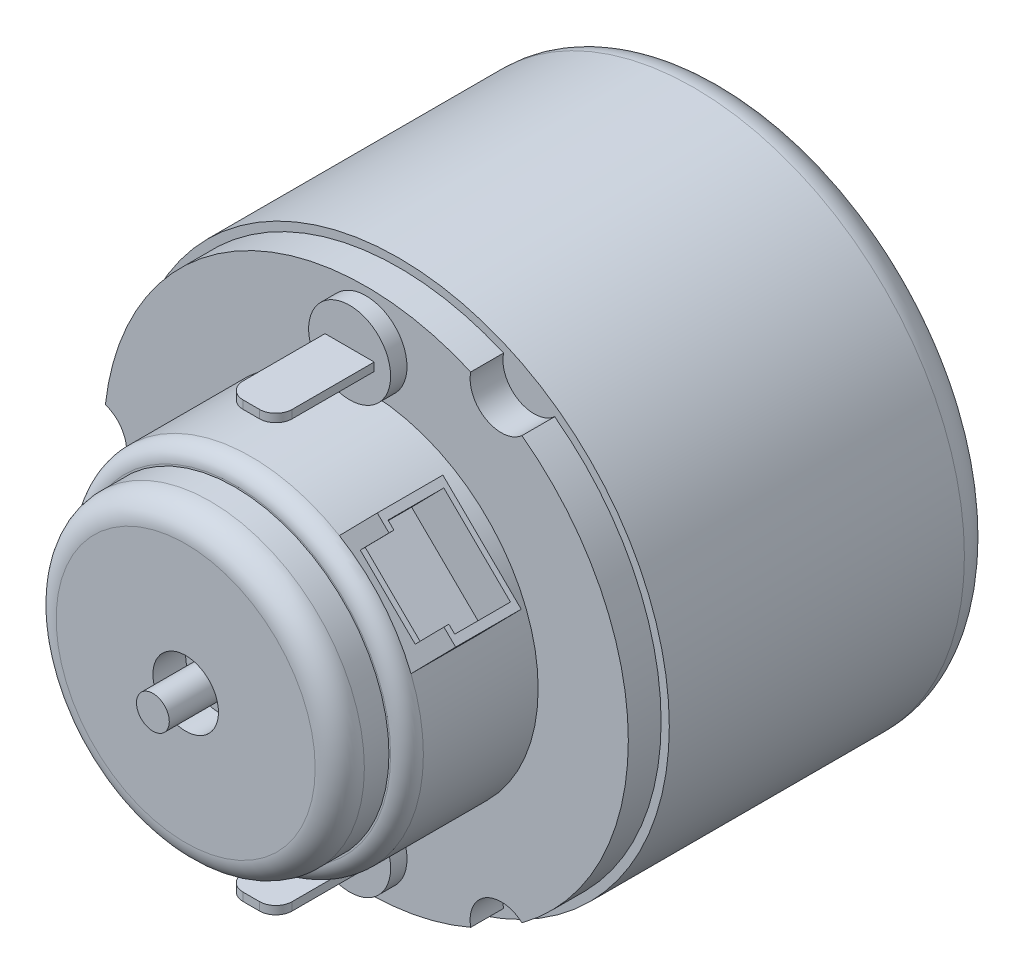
ISO-10303-21;
HEADER;
FILE_DESCRIPTION(('STEP AP214'),'2;1');
FILE_NAME('part.step','',(''),(''),'','','');
FILE_SCHEMA(('AUTOMOTIVE_DESIGN { 1 0 10303 214 1 1 1 1 }'));
ENDSEC;
DATA;
#1=APPLICATION_CONTEXT('core data for automotive mechanical design processes');
#2=APPLICATION_PROTOCOL_DEFINITION('international standard','automotive_design',2000,#1);
#3=PRODUCT_CONTEXT('',#1,'mechanical');
#4=PRODUCT('Part','Part','',(#3));
#5=PRODUCT_RELATED_PRODUCT_CATEGORY('part','',(#4));
#6=PRODUCT_DEFINITION_FORMATION('','',#4);
#7=PRODUCT_DEFINITION_CONTEXT('part definition',#1,'design');
#8=PRODUCT_DEFINITION('design','',#6,#7);
#9=PRODUCT_DEFINITION_SHAPE('','',#8);
#10=(LENGTH_UNIT() NAMED_UNIT(*) SI_UNIT(.MILLI.,.METRE.));
#11=(NAMED_UNIT(*) PLANE_ANGLE_UNIT() SI_UNIT($,.RADIAN.));
#12=(NAMED_UNIT(*) SI_UNIT($,.STERADIAN.) SOLID_ANGLE_UNIT());
#13=UNCERTAINTY_MEASURE_WITH_UNIT(LENGTH_MEASURE(1.E-05),#10,'distance_accuracy_value','');
#14=(GEOMETRIC_REPRESENTATION_CONTEXT(3) GLOBAL_UNCERTAINTY_ASSIGNED_CONTEXT((#13)) GLOBAL_UNIT_ASSIGNED_CONTEXT((#10,
#11,#12)) REPRESENTATION_CONTEXT('',''));
#15=CARTESIAN_POINT('',(0.,0.,0.));
#16=DIRECTION('',(0.,0.,1.));
#17=DIRECTION('',(1.,0.,0.));
#18=AXIS2_PLACEMENT_3D('',#15,#16,#17);
#19=CARTESIAN_POINT('',(0.,-13.,23.));
#20=DIRECTION('',(0.,0.,1.));
#21=DIRECTION('',(1.,0.,0.));
#22=AXIS2_PLACEMENT_3D('',#19,#20,#21);
#23=PLANE('',#22);
#24=CARTESIAN_POINT('',(0.,-13.,23.));
#25=DIRECTION('',(0.,0.,1.));
#26=DIRECTION('',(1.,0.,0.));
#27=AXIS2_PLACEMENT_3D('',#24,#25,#26);
#28=CIRCLE('',#27,2.5);
#29=CARTESIAN_POINT('',(2.5,-13.,23.));
#30=VERTEX_POINT('',#29);
#31=EDGE_CURVE('E136',#30,#30,#28,.T.);
#32=ORIENTED_EDGE('',*,*,#31,.T.);
#33=EDGE_LOOP('',(#32));
#34=FACE_BOUND('',#33,.T.);
#35=DIRECTION('',(1.,0.,0.));
#36=VECTOR('',#35,1.);
#37=CARTESIAN_POINT('',(1.5,-13.25,23.));
#38=LINE('',#37,#36);
#39=CARTESIAN_POINT('',(-1.5,-13.25,23.));
#40=VERTEX_POINT('',#39);
#41=CARTESIAN_POINT('',(1.5,-13.25,23.));
#42=VERTEX_POINT('',#41);
#43=EDGE_CURVE('E106',#40,#42,#38,.T.);
#44=ORIENTED_EDGE('',*,*,#43,.F.);
#45=DIRECTION('',(0.,-1.,0.));
#46=VECTOR('',#45,1.);
#47=CARTESIAN_POINT('',(-1.5,-12.75,23.));
#48=LINE('',#47,#46);
#49=CARTESIAN_POINT('',(-1.5,-12.75,23.));
#50=VERTEX_POINT('',#49);
#51=EDGE_CURVE('E114',#50,#40,#48,.T.);
#52=ORIENTED_EDGE('',*,*,#51,.F.);
#53=DIRECTION('',(-1.,0.,0.));
#54=VECTOR('',#53,1.);
#55=CARTESIAN_POINT('',(1.5,-12.75,23.));
#56=LINE('',#55,#54);
#57=CARTESIAN_POINT('',(1.5,-12.75,23.));
#58=VERTEX_POINT('',#57);
#59=EDGE_CURVE('E125',#58,#50,#56,.T.);
#60=ORIENTED_EDGE('',*,*,#59,.F.);
#61=DIRECTION('',(0.,1.,0.));
#62=VECTOR('',#61,1.);
#63=CARTESIAN_POINT('',(1.5,-12.75,23.));
#64=LINE('',#63,#62);
#65=EDGE_CURVE('E123',#42,#58,#64,.T.);
#66=ORIENTED_EDGE('',*,*,#65,.F.);
#67=EDGE_LOOP('',(#44,#52,#60,#66));
#68=FACE_BOUND('',#67,.T.);
#69=ADVANCED_FACE('F51',(#34,#68),#23,.T.);
#70=CARTESIAN_POINT('',(0.,-13.,23.));
#71=DIRECTION('',(0.,0.,-1.));
#72=DIRECTION('',(-1.,0.,0.));
#73=AXIS2_PLACEMENT_3D('',#70,#71,#72);
#74=CYLINDRICAL_SURFACE('',#73,2.5);
#75=ORIENTED_EDGE('',*,*,#31,.F.);
#76=EDGE_LOOP('',(#75));
#77=FACE_BOUND('',#76,.T.);
#78=CARTESIAN_POINT('',(0.,-13.,22.));
#79=DIRECTION('',(0.,0.,1.));
#80=DIRECTION('',(1.,0.,0.));
#81=AXIS2_PLACEMENT_3D('',#78,#79,#80);
#82=CIRCLE('',#81,2.5);
#83=CARTESIAN_POINT('',(2.5,-13.,22.));
#84=VERTEX_POINT('',#83);
#85=EDGE_CURVE('E110',#84,#84,#82,.T.);
#86=ORIENTED_EDGE('',*,*,#85,.T.);
#87=EDGE_LOOP('',(#86));
#88=FACE_BOUND('',#87,.T.);
#89=ADVANCED_FACE('F173',(#77,#88),#74,.T.);
#90=CARTESIAN_POINT('',(0.,-13.,22.));
#91=DIRECTION('',(0.,0.,1.));
#92=DIRECTION('',(1.,0.,0.));
#93=AXIS2_PLACEMENT_3D('',#90,#91,#92);
#94=PLANE('',#93);
#95=ORIENTED_EDGE('',*,*,#85,.F.);
#96=EDGE_LOOP('',(#95));
#97=FACE_BOUND('',#96,.T.);
#98=ADVANCED_FACE('F179',(#97),#94,.F.);
#99=CARTESIAN_POINT('',(-1.5,-12.75,29.));
#100=DIRECTION('',(1.,0.,0.));
#101=DIRECTION('',(0.,0.,-1.));
#102=AXIS2_PLACEMENT_3D('',#99,#100,#101);
#103=PLANE('',#102);
#104=DIRECTION('',(0.,0.,-1.));
#105=VECTOR('',#104,1.);
#106=CARTESIAN_POINT('',(-1.5,-13.25,29.));
#107=LINE('',#106,#105);
#108=CARTESIAN_POINT('',(-1.5,-13.25,28.));
#109=VERTEX_POINT('',#108);
#110=EDGE_CURVE('E102',#109,#40,#107,.T.);
#111=ORIENTED_EDGE('',*,*,#110,.F.);
#112=DIRECTION('',(0.,-1.,0.));
#113=VECTOR('',#112,1.);
#114=CARTESIAN_POINT('',(-1.5,-12.75,28.));
#115=LINE('',#114,#113);
#116=CARTESIAN_POINT('',(-1.5,-12.75,28.));
#117=VERTEX_POINT('',#116);
#118=EDGE_CURVE('E12',#109,#117,#115,.F.);
#119=ORIENTED_EDGE('',*,*,#118,.T.);
#120=DIRECTION('',(0.,0.,-1.));
#121=VECTOR('',#120,1.);
#122=CARTESIAN_POINT('',(-1.5,-12.75,29.));
#123=LINE('',#122,#121);
#124=EDGE_CURVE('E117',#117,#50,#123,.T.);
#125=ORIENTED_EDGE('',*,*,#124,.T.);
#126=ORIENTED_EDGE('',*,*,#51,.T.);
#127=EDGE_LOOP('',(#111,#119,#125,#126));
#128=FACE_BOUND('',#127,.T.);
#129=ADVANCED_FACE('F115',(#128),#103,.F.);
#130=CARTESIAN_POINT('',(1.5,-13.25,29.));
#131=DIRECTION('',(0.,1.,0.));
#132=DIRECTION('',(0.,0.,1.));
#133=AXIS2_PLACEMENT_3D('',#130,#131,#132);
#134=PLANE('',#133);
#135=DIRECTION('',(0.,0.,-1.));
#136=VECTOR('',#135,1.);
#137=CARTESIAN_POINT('',(1.5,-13.25,29.));
#138=LINE('',#137,#136);
#139=CARTESIAN_POINT('',(1.5,-13.25,28.));
#140=VERTEX_POINT('',#139);
#141=EDGE_CURVE('E111',#140,#42,#138,.T.);
#142=ORIENTED_EDGE('',*,*,#141,.F.);
#143=CARTESIAN_POINT('',(0.499999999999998,-13.25,28.));
#144=DIRECTION('',(0.,1.,0.));
#145=DIRECTION('',(0.,0.,1.));
#146=AXIS2_PLACEMENT_3D('',#143,#144,#145);
#147=CIRCLE('',#146,1.);
#148=CARTESIAN_POINT('',(0.499999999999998,-13.25,29.));
#149=VERTEX_POINT('',#148);
#150=EDGE_CURVE('E59',#140,#149,#147,.F.);
#151=ORIENTED_EDGE('',*,*,#150,.T.);
#152=DIRECTION('',(1.,0.,0.));
#153=VECTOR('',#152,1.);
#154=CARTESIAN_POINT('',(1.5,-13.25,29.));
#155=LINE('',#154,#153);
#156=CARTESIAN_POINT('',(-0.500000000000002,-13.25,29.));
#157=VERTEX_POINT('',#156);
#158=EDGE_CURVE('E130',#157,#149,#155,.T.);
#159=ORIENTED_EDGE('',*,*,#158,.F.);
#160=CARTESIAN_POINT('',(-0.500000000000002,-13.25,28.));
#161=DIRECTION('',(0.,1.,0.));
#162=DIRECTION('',(0.,0.,1.));
#163=AXIS2_PLACEMENT_3D('',#160,#161,#162);
#164=CIRCLE('',#163,1.);
#165=EDGE_CURVE('E66',#157,#109,#164,.F.);
#166=ORIENTED_EDGE('',*,*,#165,.T.);
#167=ORIENTED_EDGE('',*,*,#110,.T.);
#168=ORIENTED_EDGE('',*,*,#43,.T.);
#169=EDGE_LOOP('',(#142,#151,#159,#166,#167,#168));
#170=FACE_BOUND('',#169,.T.);
#171=ADVANCED_FACE('F104',(#170),#134,.F.);
#172=CARTESIAN_POINT('',(1.5,-12.75,29.));
#173=DIRECTION('',(-1.,0.,0.));
#174=DIRECTION('',(0.,-1.,0.));
#175=AXIS2_PLACEMENT_3D('',#172,#173,#174);
#176=PLANE('',#175);
#177=DIRECTION('',(0.,0.,-1.));
#178=VECTOR('',#177,1.);
#179=CARTESIAN_POINT('',(1.5,-12.75,29.));
#180=LINE('',#179,#178);
#181=CARTESIAN_POINT('',(1.5,-12.75,28.));
#182=VERTEX_POINT('',#181);
#183=EDGE_CURVE('E132',#182,#58,#180,.T.);
#184=ORIENTED_EDGE('',*,*,#183,.F.);
#185=DIRECTION('',(0.,1.,0.));
#186=VECTOR('',#185,1.);
#187=CARTESIAN_POINT('',(1.5,-12.75,28.));
#188=LINE('',#187,#186);
#189=EDGE_CURVE('E74',#182,#140,#188,.F.);
#190=ORIENTED_EDGE('',*,*,#189,.T.);
#191=ORIENTED_EDGE('',*,*,#141,.T.);
#192=ORIENTED_EDGE('',*,*,#65,.T.);
#193=EDGE_LOOP('',(#184,#190,#191,#192));
#194=FACE_BOUND('',#193,.T.);
#195=ADVANCED_FACE('F165',(#194),#176,.F.);
#196=CARTESIAN_POINT('',(1.5,-12.75,29.));
#197=DIRECTION('',(0.,-1.,0.));
#198=DIRECTION('',(0.,0.,-1.));
#199=AXIS2_PLACEMENT_3D('',#196,#197,#198);
#200=PLANE('',#199);
#201=DIRECTION('',(-1.,0.,0.));
#202=VECTOR('',#201,1.);
#203=CARTESIAN_POINT('',(1.5,-12.75,29.));
#204=LINE('',#203,#202);
#205=CARTESIAN_POINT('',(0.499999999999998,-12.75,29.));
#206=VERTEX_POINT('',#205);
#207=CARTESIAN_POINT('',(-0.500000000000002,-12.75,29.));
#208=VERTEX_POINT('',#207);
#209=EDGE_CURVE('E133',#206,#208,#204,.T.);
#210=ORIENTED_EDGE('',*,*,#209,.F.);
#211=CARTESIAN_POINT('',(0.499999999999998,-12.75,28.));
#212=DIRECTION('',(0.,-1.,0.));
#213=DIRECTION('',(0.,0.,-1.));
#214=AXIS2_PLACEMENT_3D('',#211,#212,#213);
#215=CIRCLE('',#214,1.);
#216=EDGE_CURVE('E149',#206,#182,#215,.F.);
#217=ORIENTED_EDGE('',*,*,#216,.T.);
#218=ORIENTED_EDGE('',*,*,#183,.T.);
#219=ORIENTED_EDGE('',*,*,#59,.T.);
#220=ORIENTED_EDGE('',*,*,#124,.F.);
#221=CARTESIAN_POINT('',(-0.500000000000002,-12.75,28.));
#222=DIRECTION('',(0.,-1.,0.));
#223=DIRECTION('',(0.,0.,-1.));
#224=AXIS2_PLACEMENT_3D('',#221,#222,#223);
#225=CIRCLE('',#224,1.);
#226=EDGE_CURVE('E147',#117,#208,#225,.F.);
#227=ORIENTED_EDGE('',*,*,#226,.T.);
#228=EDGE_LOOP('',(#210,#217,#218,#219,#220,#227));
#229=FACE_BOUND('',#228,.T.);
#230=ADVANCED_FACE('F164',(#229),#200,.F.);
#231=CARTESIAN_POINT('',(-1.5,-13.25,29.));
#232=DIRECTION('',(0.,0.,-1.));
#233=DIRECTION('',(-1.,0.,0.));
#234=AXIS2_PLACEMENT_3D('',#231,#232,#233);
#235=PLANE('',#234);
#236=ORIENTED_EDGE('',*,*,#158,.T.);
#237=DIRECTION('',(0.,1.,0.));
#238=VECTOR('',#237,1.);
#239=CARTESIAN_POINT('',(0.499999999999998,-13.25,29.));
#240=LINE('',#239,#238);
#241=EDGE_CURVE('E144',#149,#206,#240,.T.);
#242=ORIENTED_EDGE('',*,*,#241,.T.);
#243=ORIENTED_EDGE('',*,*,#209,.T.);
#244=DIRECTION('',(0.,-1.,0.));
#245=VECTOR('',#244,1.);
#246=CARTESIAN_POINT('',(-0.500000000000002,-13.25,29.));
#247=LINE('',#246,#245);
#248=EDGE_CURVE('E139',#208,#157,#247,.T.);
#249=ORIENTED_EDGE('',*,*,#248,.T.);
#250=EDGE_LOOP('',(#236,#242,#243,#249));
#251=FACE_BOUND('',#250,.T.);
#252=ADVANCED_FACE('F157',(#251),#235,.F.);
#253=CARTESIAN_POINT('',(0.499999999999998,-13.25,28.));
#254=DIRECTION('',(0.,1.,0.));
#255=DIRECTION('',(-1.,0.,0.));
#256=AXIS2_PLACEMENT_3D('',#253,#254,#255);
#257=CYLINDRICAL_SURFACE('',#256,1.);
#258=ORIENTED_EDGE('',*,*,#150,.F.);
#259=ORIENTED_EDGE('',*,*,#189,.F.);
#260=ORIENTED_EDGE('',*,*,#216,.F.);
#261=ORIENTED_EDGE('',*,*,#241,.F.);
#262=EDGE_LOOP('',(#258,#259,#260,#261));
#263=FACE_BOUND('',#262,.T.);
#264=ADVANCED_FACE('F162',(#263),#257,.T.);
#265=CARTESIAN_POINT('',(-0.500000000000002,-13.25,28.));
#266=DIRECTION('',(0.,-1.,0.));
#267=DIRECTION('',(0.,0.,-1.));
#268=AXIS2_PLACEMENT_3D('',#265,#266,#267);
#269=CYLINDRICAL_SURFACE('',#268,1.);
#270=ORIENTED_EDGE('',*,*,#226,.F.);
#271=ORIENTED_EDGE('',*,*,#118,.F.);
#272=ORIENTED_EDGE('',*,*,#165,.F.);
#273=ORIENTED_EDGE('',*,*,#248,.F.);
#274=EDGE_LOOP('',(#270,#271,#272,#273));
#275=FACE_BOUND('',#274,.T.);
#276=ADVANCED_FACE('F53',(#275),#269,.T.);
#277=CLOSED_SHELL('',(#69,#89,#98,#129,#171,#195,#230,#252,#264,#276));
#278=MANIFOLD_SOLID_BREP('B2',#277);
#279=CARTESIAN_POINT('',(0.,13.,23.));
#280=DIRECTION('',(0.,0.,1.));
#281=DIRECTION('',(1.,0.,0.));
#282=AXIS2_PLACEMENT_3D('',#279,#280,#281);
#283=PLANE('',#282);
#284=CARTESIAN_POINT('',(0.,13.,23.));
#285=DIRECTION('',(0.,0.,1.));
#286=DIRECTION('',(1.,0.,0.));
#287=AXIS2_PLACEMENT_3D('',#284,#285,#286);
#288=CIRCLE('',#287,2.5);
#289=CARTESIAN_POINT('',(2.5,13.,23.));
#290=VERTEX_POINT('',#289);
#291=EDGE_CURVE('E350',#290,#290,#288,.T.);
#292=ORIENTED_EDGE('',*,*,#291,.T.);
#293=EDGE_LOOP('',(#292));
#294=FACE_BOUND('',#293,.T.);
#295=DIRECTION('',(1.,0.,0.));
#296=VECTOR('',#295,1.);
#297=CARTESIAN_POINT('',(1.5,12.75,23.));
#298=LINE('',#297,#296);
#299=CARTESIAN_POINT('',(-1.5,12.75,23.));
#300=VERTEX_POINT('',#299);
#301=CARTESIAN_POINT('',(1.5,12.75,23.));
#302=VERTEX_POINT('',#301);
#303=EDGE_CURVE('E320',#300,#302,#298,.T.);
#304=ORIENTED_EDGE('',*,*,#303,.F.);
#305=DIRECTION('',(0.,-1.,0.));
#306=VECTOR('',#305,1.);
#307=CARTESIAN_POINT('',(-1.5,13.25,23.));
#308=LINE('',#307,#306);
#309=CARTESIAN_POINT('',(-1.5,13.25,23.));
#310=VERTEX_POINT('',#309);
#311=EDGE_CURVE('E328',#310,#300,#308,.T.);
#312=ORIENTED_EDGE('',*,*,#311,.F.);
#313=DIRECTION('',(-1.,0.,0.));
#314=VECTOR('',#313,1.);
#315=CARTESIAN_POINT('',(1.5,13.25,23.));
#316=LINE('',#315,#314);
#317=CARTESIAN_POINT('',(1.5,13.25,23.));
#318=VERTEX_POINT('',#317);
#319=EDGE_CURVE('E339',#318,#310,#316,.T.);
#320=ORIENTED_EDGE('',*,*,#319,.F.);
#321=DIRECTION('',(0.,1.,0.));
#322=VECTOR('',#321,1.);
#323=CARTESIAN_POINT('',(1.5,13.25,23.));
#324=LINE('',#323,#322);
#325=EDGE_CURVE('E337',#302,#318,#324,.T.);
#326=ORIENTED_EDGE('',*,*,#325,.F.);
#327=EDGE_LOOP('',(#304,#312,#320,#326));
#328=FACE_BOUND('',#327,.T.);
#329=ADVANCED_FACE('F265',(#294,#328),#283,.T.);
#330=CARTESIAN_POINT('',(0.,13.,23.));
#331=DIRECTION('',(0.,0.,-1.));
#332=DIRECTION('',(-1.,0.,0.));
#333=AXIS2_PLACEMENT_3D('',#330,#331,#332);
#334=CYLINDRICAL_SURFACE('',#333,2.5);
#335=ORIENTED_EDGE('',*,*,#291,.F.);
#336=EDGE_LOOP('',(#335));
#337=FACE_BOUND('',#336,.T.);
#338=CARTESIAN_POINT('',(0.,13.,22.));
#339=DIRECTION('',(0.,0.,1.));
#340=DIRECTION('',(1.,0.,0.));
#341=AXIS2_PLACEMENT_3D('',#338,#339,#340);
#342=CIRCLE('',#341,2.5);
#343=CARTESIAN_POINT('',(2.5,13.,22.));
#344=VERTEX_POINT('',#343);
#345=EDGE_CURVE('E324',#344,#344,#342,.T.);
#346=ORIENTED_EDGE('',*,*,#345,.T.);
#347=EDGE_LOOP('',(#346));
#348=FACE_BOUND('',#347,.T.);
#349=ADVANCED_FACE('F387',(#337,#348),#334,.T.);
#350=CARTESIAN_POINT('',(0.,13.,22.));
#351=DIRECTION('',(0.,0.,1.));
#352=DIRECTION('',(1.,0.,0.));
#353=AXIS2_PLACEMENT_3D('',#350,#351,#352);
#354=PLANE('',#353);
#355=ORIENTED_EDGE('',*,*,#345,.F.);
#356=EDGE_LOOP('',(#355));
#357=FACE_BOUND('',#356,.T.);
#358=ADVANCED_FACE('F393',(#357),#354,.F.);
#359=CARTESIAN_POINT('',(-1.5,13.25,29.));
#360=DIRECTION('',(1.,0.,0.));
#361=DIRECTION('',(0.,0.,-1.));
#362=AXIS2_PLACEMENT_3D('',#359,#360,#361);
#363=PLANE('',#362);
#364=DIRECTION('',(0.,0.,-1.));
#365=VECTOR('',#364,1.);
#366=CARTESIAN_POINT('',(-1.5,12.75,29.));
#367=LINE('',#366,#365);
#368=CARTESIAN_POINT('',(-1.5,12.75,28.));
#369=VERTEX_POINT('',#368);
#370=EDGE_CURVE('E316',#369,#300,#367,.T.);
#371=ORIENTED_EDGE('',*,*,#370,.F.);
#372=DIRECTION('',(0.,-1.,0.));
#373=VECTOR('',#372,1.);
#374=CARTESIAN_POINT('',(-1.5,13.25,28.));
#375=LINE('',#374,#373);
#376=CARTESIAN_POINT('',(-1.5,13.25,28.));
#377=VERTEX_POINT('',#376);
#378=EDGE_CURVE('E49',#369,#377,#375,.F.);
#379=ORIENTED_EDGE('',*,*,#378,.T.);
#380=DIRECTION('',(0.,0.,-1.));
#381=VECTOR('',#380,1.);
#382=CARTESIAN_POINT('',(-1.5,13.25,29.));
#383=LINE('',#382,#381);
#384=EDGE_CURVE('E331',#377,#310,#383,.T.);
#385=ORIENTED_EDGE('',*,*,#384,.T.);
#386=ORIENTED_EDGE('',*,*,#311,.T.);
#387=EDGE_LOOP('',(#371,#379,#385,#386));
#388=FACE_BOUND('',#387,.T.);
#389=ADVANCED_FACE('F329',(#388),#363,.F.);
#390=CARTESIAN_POINT('',(1.5,12.75,29.));
#391=DIRECTION('',(0.,1.,0.));
#392=DIRECTION('',(0.,0.,1.));
#393=AXIS2_PLACEMENT_3D('',#390,#391,#392);
#394=PLANE('',#393);
#395=DIRECTION('',(0.,0.,-1.));
#396=VECTOR('',#395,1.);
#397=CARTESIAN_POINT('',(1.5,12.75,29.));
#398=LINE('',#397,#396);
#399=CARTESIAN_POINT('',(1.5,12.75,28.));
#400=VERTEX_POINT('',#399);
#401=EDGE_CURVE('E325',#400,#302,#398,.T.);
#402=ORIENTED_EDGE('',*,*,#401,.F.);
#403=CARTESIAN_POINT('',(0.500000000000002,12.75,28.));
#404=DIRECTION('',(0.,1.,0.));
#405=DIRECTION('',(0.,0.,1.));
#406=AXIS2_PLACEMENT_3D('',#403,#404,#405);
#407=CIRCLE('',#406,1.);
#408=CARTESIAN_POINT('',(0.500000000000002,12.75,29.));
#409=VERTEX_POINT('',#408);
#410=EDGE_CURVE('E273',#400,#409,#407,.F.);
#411=ORIENTED_EDGE('',*,*,#410,.T.);
#412=DIRECTION('',(1.,0.,0.));
#413=VECTOR('',#412,1.);
#414=CARTESIAN_POINT('',(1.5,12.75,29.));
#415=LINE('',#414,#413);
#416=CARTESIAN_POINT('',(-0.499999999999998,12.75,29.));
#417=VERTEX_POINT('',#416);
#418=EDGE_CURVE('E344',#417,#409,#415,.T.);
#419=ORIENTED_EDGE('',*,*,#418,.F.);
#420=CARTESIAN_POINT('',(-0.499999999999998,12.75,28.));
#421=DIRECTION('',(0.,1.,0.));
#422=DIRECTION('',(0.,0.,1.));
#423=AXIS2_PLACEMENT_3D('',#420,#421,#422);
#424=CIRCLE('',#423,1.);
#425=EDGE_CURVE('E280',#417,#369,#424,.F.);
#426=ORIENTED_EDGE('',*,*,#425,.T.);
#427=ORIENTED_EDGE('',*,*,#370,.T.);
#428=ORIENTED_EDGE('',*,*,#303,.T.);
#429=EDGE_LOOP('',(#402,#411,#419,#426,#427,#428));
#430=FACE_BOUND('',#429,.T.);
#431=ADVANCED_FACE('F318',(#430),#394,.F.);
#432=CARTESIAN_POINT('',(1.5,13.25,29.));
#433=DIRECTION('',(-1.,0.,0.));
#434=DIRECTION('',(0.,0.,1.));
#435=AXIS2_PLACEMENT_3D('',#432,#433,#434);
#436=PLANE('',#435);
#437=DIRECTION('',(0.,0.,-1.));
#438=VECTOR('',#437,1.);
#439=CARTESIAN_POINT('',(1.5,13.25,29.));
#440=LINE('',#439,#438);
#441=CARTESIAN_POINT('',(1.5,13.25,28.));
#442=VERTEX_POINT('',#441);
#443=EDGE_CURVE('E346',#442,#318,#440,.T.);
#444=ORIENTED_EDGE('',*,*,#443,.F.);
#445=DIRECTION('',(0.,1.,0.));
#446=VECTOR('',#445,1.);
#447=CARTESIAN_POINT('',(1.5,13.25,28.));
#448=LINE('',#447,#446);
#449=EDGE_CURVE('E288',#442,#400,#448,.F.);
#450=ORIENTED_EDGE('',*,*,#449,.T.);
#451=ORIENTED_EDGE('',*,*,#401,.T.);
#452=ORIENTED_EDGE('',*,*,#325,.T.);
#453=EDGE_LOOP('',(#444,#450,#451,#452));
#454=FACE_BOUND('',#453,.T.);
#455=ADVANCED_FACE('F379',(#454),#436,.F.);
#456=CARTESIAN_POINT('',(1.5,13.25,29.));
#457=DIRECTION('',(0.,-1.,0.));
#458=DIRECTION('',(0.,0.,-1.));
#459=AXIS2_PLACEMENT_3D('',#456,#457,#458);
#460=PLANE('',#459);
#461=DIRECTION('',(-1.,0.,0.));
#462=VECTOR('',#461,1.);
#463=CARTESIAN_POINT('',(1.5,13.25,29.));
#464=LINE('',#463,#462);
#465=CARTESIAN_POINT('',(0.500000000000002,13.25,29.));
#466=VERTEX_POINT('',#465);
#467=CARTESIAN_POINT('',(-0.499999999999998,13.25,29.));
#468=VERTEX_POINT('',#467);
#469=EDGE_CURVE('E347',#466,#468,#464,.T.);
#470=ORIENTED_EDGE('',*,*,#469,.F.);
#471=CARTESIAN_POINT('',(0.500000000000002,13.25,28.));
#472=DIRECTION('',(0.,-1.,0.));
#473=DIRECTION('',(0.,0.,-1.));
#474=AXIS2_PLACEMENT_3D('',#471,#472,#473);
#475=CIRCLE('',#474,1.);
#476=EDGE_CURVE('E363',#466,#442,#475,.F.);
#477=ORIENTED_EDGE('',*,*,#476,.T.);
#478=ORIENTED_EDGE('',*,*,#443,.T.);
#479=ORIENTED_EDGE('',*,*,#319,.T.);
#480=ORIENTED_EDGE('',*,*,#384,.F.);
#481=CARTESIAN_POINT('',(-0.499999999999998,13.25,28.));
#482=DIRECTION('',(0.,-1.,0.));
#483=DIRECTION('',(0.,0.,-1.));
#484=AXIS2_PLACEMENT_3D('',#481,#482,#483);
#485=CIRCLE('',#484,1.);
#486=EDGE_CURVE('E361',#377,#468,#485,.F.);
#487=ORIENTED_EDGE('',*,*,#486,.T.);
#488=EDGE_LOOP('',(#470,#477,#478,#479,#480,#487));
#489=FACE_BOUND('',#488,.T.);
#490=ADVANCED_FACE('F378',(#489),#460,.F.);
#491=CARTESIAN_POINT('',(-1.5,12.75,29.));
#492=DIRECTION('',(0.,0.,-1.));
#493=DIRECTION('',(-1.,0.,0.));
#494=AXIS2_PLACEMENT_3D('',#491,#492,#493);
#495=PLANE('',#494);
#496=ORIENTED_EDGE('',*,*,#418,.T.);
#497=DIRECTION('',(0.,1.,0.));
#498=VECTOR('',#497,1.);
#499=CARTESIAN_POINT('',(0.500000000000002,12.75,29.));
#500=LINE('',#499,#498);
#501=EDGE_CURVE('E358',#409,#466,#500,.T.);
#502=ORIENTED_EDGE('',*,*,#501,.T.);
#503=ORIENTED_EDGE('',*,*,#469,.T.);
#504=DIRECTION('',(0.,-1.,0.));
#505=VECTOR('',#504,1.);
#506=CARTESIAN_POINT('',(-0.499999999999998,12.75,29.));
#507=LINE('',#506,#505);
#508=EDGE_CURVE('E353',#468,#417,#507,.T.);
#509=ORIENTED_EDGE('',*,*,#508,.T.);
#510=EDGE_LOOP('',(#496,#502,#503,#509));
#511=FACE_BOUND('',#510,.T.);
#512=ADVANCED_FACE('F371',(#511),#495,.F.);
#513=CARTESIAN_POINT('',(0.500000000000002,12.75,28.));
#514=DIRECTION('',(0.,1.,0.));
#515=DIRECTION('',(0.,0.,1.));
#516=AXIS2_PLACEMENT_3D('',#513,#514,#515);
#517=CYLINDRICAL_SURFACE('',#516,1.);
#518=ORIENTED_EDGE('',*,*,#410,.F.);
#519=ORIENTED_EDGE('',*,*,#449,.F.);
#520=ORIENTED_EDGE('',*,*,#476,.F.);
#521=ORIENTED_EDGE('',*,*,#501,.F.);
#522=EDGE_LOOP('',(#518,#519,#520,#521));
#523=FACE_BOUND('',#522,.T.);
#524=ADVANCED_FACE('F376',(#523),#517,.T.);
#525=CARTESIAN_POINT('',(-0.499999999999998,12.75,28.));
#526=DIRECTION('',(0.,-1.,0.));
#527=DIRECTION('',(0.,0.,-1.));
#528=AXIS2_PLACEMENT_3D('',#525,#526,#527);
#529=CYLINDRICAL_SURFACE('',#528,1.);
#530=ORIENTED_EDGE('',*,*,#486,.F.);
#531=ORIENTED_EDGE('',*,*,#378,.F.);
#532=ORIENTED_EDGE('',*,*,#425,.F.);
#533=ORIENTED_EDGE('',*,*,#508,.F.);
#534=EDGE_LOOP('',(#530,#531,#532,#533));
#535=FACE_BOUND('',#534,.T.);
#536=ADVANCED_FACE('F267',(#535),#529,.T.);
#537=CLOSED_SHELL('',(#329,#349,#358,#389,#431,#455,#490,#512,#524,#536));
#538=MANIFOLD_SOLID_BREP('B6',#537);
#539=CARTESIAN_POINT('',(0.,0.,30.));
#540=DIRECTION('',(0.,0.,-1.));
#541=DIRECTION('',(-1.,0.,0.));
#542=AXIS2_PLACEMENT_3D('',#539,#540,#541);
#543=CYLINDRICAL_SURFACE('',#542,10.5);
#544=CARTESIAN_POINT('',(0.,0.,22.));
#545=DIRECTION('',(0.,0.,1.));
#546=DIRECTION('',(1.,0.,0.));
#547=AXIS2_PLACEMENT_3D('',#544,#545,#546);
#548=CIRCLE('',#547,10.5);
#549=CARTESIAN_POINT('',(10.5,0.,22.));
#550=VERTEX_POINT('',#549);
#551=EDGE_CURVE('E724',#550,#550,#548,.T.);
#552=ORIENTED_EDGE('',*,*,#551,.T.);
#553=EDGE_LOOP('',(#552));
#554=FACE_BOUND('',#553,.T.);
#555=DIRECTION('',(0.,0.,-1.));
#556=VECTOR('',#555,1.);
#557=CARTESIAN_POINT('',(9.74537751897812,3.9086592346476,30.));
#558=LINE('',#557,#556);
#559=CARTESIAN_POINT('',(9.74537751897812,3.9086592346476,29.));
#560=VERTEX_POINT('',#559);
#561=CARTESIAN_POINT('',(9.7453775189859,3.90865923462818,25.));
#562=VERTEX_POINT('',#561);
#563=EDGE_CURVE('E672',#560,#562,#558,.T.);
#564=ORIENTED_EDGE('',*,*,#563,.F.);
#565=CARTESIAN_POINT('',(0.,0.,29.));
#566=DIRECTION('',(0.,0.,1.));
#567=DIRECTION('',(1.,0.,0.));
#568=AXIS2_PLACEMENT_3D('',#565,#566,#567);
#569=CIRCLE('',#568,10.5);
#570=CARTESIAN_POINT('',(5.37487332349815,9.02001866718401,29.));
#571=VERTEX_POINT('',#570);
#572=EDGE_CURVE('E830',#560,#571,#569,.F.);
#573=ORIENTED_EDGE('',*,*,#572,.T.);
#574=DIRECTION('',(0.,0.,-1.));
#575=VECTOR('',#574,1.);
#576=CARTESIAN_POINT('',(5.37487332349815,9.02001866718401,30.));
#577=LINE('',#576,#575);
#578=CARTESIAN_POINT('',(5.37487332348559,9.02001866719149,25.));
#579=VERTEX_POINT('',#578);
#580=EDGE_CURVE('E681',#579,#571,#577,.F.);
#581=ORIENTED_EDGE('',*,*,#580,.F.);
#582=CARTESIAN_POINT('',(0.,0.,25.));
#583=DIRECTION('',(0.,0.,-1.));
#584=DIRECTION('',(-1.,0.,0.));
#585=AXIS2_PLACEMENT_3D('',#582,#583,#584);
#586=CIRCLE('',#585,10.5);
#587=EDGE_CURVE('E682',#562,#579,#586,.F.);
#588=ORIENTED_EDGE('',*,*,#587,.F.);
#589=EDGE_LOOP('',(#564,#573,#581,#588));
#590=FACE_BOUND('',#589,.T.);
#591=ADVANCED_FACE('F470',(#554,#590),#543,.T.);
#592=CARTESIAN_POINT('',(0.,0.,31.));
#593=DIRECTION('',(0.,0.,1.));
#594=DIRECTION('',(1.,0.,0.));
#595=AXIS2_PLACEMENT_3D('',#592,#593,#594);
#596=PLANE('',#595);
#597=CARTESIAN_POINT('',(0.,0.,31.));
#598=DIRECTION('',(0.,0.,1.));
#599=DIRECTION('',(1.,0.,0.));
#600=AXIS2_PLACEMENT_3D('',#597,#598,#599);
#601=CIRCLE('',#600,2.);
#602=CARTESIAN_POINT('',(2.,0.,31.));
#603=VERTEX_POINT('',#602);
#604=EDGE_CURVE('E716',#603,#603,#601,.T.);
#605=ORIENTED_EDGE('',*,*,#604,.T.);
#606=EDGE_LOOP('',(#605));
#607=FACE_BOUND('',#606,.T.);
#608=CARTESIAN_POINT('',(0.,0.,31.));
#609=DIRECTION('',(0.,0.,1.));
#610=DIRECTION('',(1.,0.,0.));
#611=AXIS2_PLACEMENT_3D('',#608,#609,#610);
#612=CIRCLE('',#611,1.);
#613=CARTESIAN_POINT('',(1.,0.,31.));
#614=VERTEX_POINT('',#613);
#615=EDGE_CURVE('E709',#614,#614,#612,.T.);
#616=ORIENTED_EDGE('',*,*,#615,.F.);
#617=EDGE_LOOP('',(#616));
#618=FACE_BOUND('',#617,.T.);
#619=ADVANCED_FACE('F853',(#607,#618),#596,.T.);
#620=CARTESIAN_POINT('',(0.,0.,30.));
#621=DIRECTION('',(0.,0.,1.));
#622=DIRECTION('',(1.,0.,0.));
#623=AXIS2_PLACEMENT_3D('',#620,#621,#622);
#624=PLANE('',#623);
#625=CARTESIAN_POINT('',(0.,0.,30.));
#626=DIRECTION('',(0.,0.,1.));
#627=DIRECTION('',(1.,0.,0.));
#628=AXIS2_PLACEMENT_3D('',#625,#626,#627);
#629=CIRCLE('',#628,9.5);
#630=CARTESIAN_POINT('',(9.5,0.,30.));
#631=VERTEX_POINT('',#630);
#632=EDGE_CURVE('E827',#631,#631,#629,.T.);
#633=ORIENTED_EDGE('',*,*,#632,.T.);
#634=EDGE_LOOP('',(#633));
#635=FACE_BOUND('',#634,.T.);
#636=CARTESIAN_POINT('',(0.,0.,30.));
#637=DIRECTION('',(0.,0.,1.));
#638=DIRECTION('',(1.,0.,0.));
#639=AXIS2_PLACEMENT_3D('',#636,#637,#638);
#640=CIRCLE('',#639,9.4);
#641=CARTESIAN_POINT('',(9.4,0.,30.));
#642=VERTEX_POINT('',#641);
#643=EDGE_CURVE('E719',#642,#642,#640,.T.);
#644=ORIENTED_EDGE('',*,*,#643,.F.);
#645=EDGE_LOOP('',(#644));
#646=FACE_BOUND('',#645,.T.);
#647=ADVANCED_FACE('F859',(#635,#646),#624,.T.);
#648=CARTESIAN_POINT('',(0.,0.,22.));
#649=DIRECTION('',(0.,0.,1.));
#650=DIRECTION('',(1.,0.,0.));
#651=AXIS2_PLACEMENT_3D('',#648,#649,#650);
#652=PLANE('',#651);
#653=CARTESIAN_POINT('',(8.24999999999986,14.2894191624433,22.));
#654=DIRECTION('',(0.,0.,1.));
#655=DIRECTION('',(1.,0.,0.));
#656=AXIS2_PLACEMENT_3D('',#653,#654,#655);
#657=CIRCLE('',#656,1.90000000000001);
#658=CARTESIAN_POINT('',(6.38836634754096,14.669314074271,22.));
#659=VERTEX_POINT('',#658);
#660=CARTESIAN_POINT('',(9.50981547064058,12.8671445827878,22.));
#661=VERTEX_POINT('',#660);
#662=EDGE_CURVE('E728',#659,#661,#657,.T.);
#663=ORIENTED_EDGE('',*,*,#662,.F.);
#664=CARTESIAN_POINT('',(0.,0.,22.));
#665=DIRECTION('',(0.,0.,1.));
#666=DIRECTION('',(1.,0.,0.));
#667=AXIS2_PLACEMENT_3D('',#664,#665,#666);
#668=CIRCLE('',#667,16.);
#669=CARTESIAN_POINT('',(-15.8981818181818,1.80216949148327,22.));
#670=VERTEX_POINT('',#669);
#671=EDGE_CURVE('E731',#659,#670,#668,.T.);
#672=ORIENTED_EDGE('',*,*,#671,.T.);
#673=CARTESIAN_POINT('',(-16.5,0.,22.));
#674=DIRECTION('',(0.,0.,1.));
#675=DIRECTION('',(1.,0.,0.));
#676=AXIS2_PLACEMENT_3D('',#673,#674,#675);
#677=CIRCLE('',#676,1.90000000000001);
#678=CARTESIAN_POINT('',(-15.8981818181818,-1.80216949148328,22.));
#679=VERTEX_POINT('',#678);
#680=EDGE_CURVE('E734',#679,#670,#677,.T.);
#681=ORIENTED_EDGE('',*,*,#680,.F.);
#682=CARTESIAN_POINT('',(6.38836634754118,-14.6693140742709,22.));
#683=VERTEX_POINT('',#682);
#684=EDGE_CURVE('E735',#679,#683,#668,.T.);
#685=ORIENTED_EDGE('',*,*,#684,.T.);
#686=CARTESIAN_POINT('',(8.25000000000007,-14.2894191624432,22.));
#687=DIRECTION('',(0.,0.,1.));
#688=DIRECTION('',(1.,0.,0.));
#689=AXIS2_PLACEMENT_3D('',#686,#687,#688);
#690=CIRCLE('',#689,1.90000000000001);
#691=CARTESIAN_POINT('',(9.50981547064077,-12.8671445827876,22.));
#692=VERTEX_POINT('',#691);
#693=EDGE_CURVE('E738',#692,#683,#690,.T.);
#694=ORIENTED_EDGE('',*,*,#693,.F.);
#695=CARTESIAN_POINT('',(0.,0.,22.));
#696=DIRECTION('',(0.,0.,1.));
#697=DIRECTION('',(1.,0.,0.));
#698=AXIS2_PLACEMENT_3D('',#695,#696,#697);
#699=CIRCLE('',#698,16.);
#700=EDGE_CURVE('E741',#692,#661,#699,.T.);
#701=ORIENTED_EDGE('',*,*,#700,.T.);
#702=EDGE_LOOP('',(#663,#672,#681,#685,#694,#701));
#703=FACE_BOUND('',#702,.T.);
#704=ORIENTED_EDGE('',*,*,#551,.F.);
#705=EDGE_LOOP('',(#704));
#706=FACE_BOUND('',#705,.T.);
#707=ADVANCED_FACE('F866',(#703,#706),#652,.T.);
#708=CARTESIAN_POINT('',(-36.4414213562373,0.,-1.5));
#709=DIRECTION('',(0.,0.,-1.));
#710=DIRECTION('',(-1.,0.,0.));
#711=AXIS2_PLACEMENT_3D('',#708,#709,#710);
#712=PLANE('',#711);
#713=CARTESIAN_POINT('',(0.,0.,-1.5));
#714=DIRECTION('',(0.,0.,-1.));
#715=DIRECTION('',(-1.,0.,0.));
#716=AXIS2_PLACEMENT_3D('',#713,#714,#715);
#717=CIRCLE('',#716,3.5);
#718=CARTESIAN_POINT('',(-3.5,0.,-1.5));
#719=VERTEX_POINT('',#718);
#720=EDGE_CURVE('E810',#719,#719,#717,.T.);
#721=ORIENTED_EDGE('',*,*,#720,.T.);
#722=EDGE_LOOP('',(#721));
#723=FACE_BOUND('',#722,.T.);
#724=CARTESIAN_POINT('',(0.,0.,-1.5));
#725=DIRECTION('',(0.,0.,-1.));
#726=DIRECTION('',(-1.,0.,0.));
#727=AXIS2_PLACEMENT_3D('',#724,#725,#726);
#728=CIRCLE('',#727,1.);
#729=CARTESIAN_POINT('',(-1.,0.,-1.5));
#730=VERTEX_POINT('',#729);
#731=EDGE_CURVE('E806',#730,#730,#728,.T.);
#732=ORIENTED_EDGE('',*,*,#731,.F.);
#733=EDGE_LOOP('',(#732));
#734=FACE_BOUND('',#733,.T.);
#735=ADVANCED_FACE('F869',(#723,#734),#712,.T.);
#736=CARTESIAN_POINT('',(0.,0.,0.));
#737=DIRECTION('',(0.,0.,1.));
#738=DIRECTION('',(1.,0.,0.));
#739=AXIS2_PLACEMENT_3D('',#736,#737,#738);
#740=PLANE('',#739);
#741=CARTESIAN_POINT('',(0.,0.,0.));
#742=DIRECTION('',(0.,0.,1.));
#743=DIRECTION('',(1.,0.,0.));
#744=AXIS2_PLACEMENT_3D('',#741,#742,#743);
#745=CIRCLE('',#744,14.5);
#746=CARTESIAN_POINT('',(14.5,0.,0.));
#747=VERTEX_POINT('',#746);
#748=EDGE_CURVE('E824',#747,#747,#745,.F.);
#749=ORIENTED_EDGE('',*,*,#748,.T.);
#750=EDGE_LOOP('',(#749));
#751=FACE_BOUND('',#750,.T.);
#752=CARTESIAN_POINT('',(-11.2583302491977,-6.49999999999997,0.));
#753=DIRECTION('',(0.,0.,-1.));
#754=DIRECTION('',(-1.,0.,0.));
#755=AXIS2_PLACEMENT_3D('',#752,#753,#754);
#756=CIRCLE('',#755,1.025);
#757=CARTESIAN_POINT('',(-12.2833302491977,-6.49999999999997,0.));
#758=VERTEX_POINT('',#757);
#759=EDGE_CURVE('E770',#758,#758,#756,.T.);
#760=ORIENTED_EDGE('',*,*,#759,.F.);
#761=EDGE_LOOP('',(#760));
#762=FACE_BOUND('',#761,.T.);
#763=CARTESIAN_POINT('',(0.,13.,0.));
#764=DIRECTION('',(0.,0.,-1.));
#765=DIRECTION('',(-1.,0.,0.));
#766=AXIS2_PLACEMENT_3D('',#763,#764,#765);
#767=CIRCLE('',#766,1.025);
#768=CARTESIAN_POINT('',(-1.025,13.,0.));
#769=VERTEX_POINT('',#768);
#770=EDGE_CURVE('E776',#769,#769,#767,.T.);
#771=ORIENTED_EDGE('',*,*,#770,.F.);
#772=EDGE_LOOP('',(#771));
#773=FACE_BOUND('',#772,.T.);
#774=CARTESIAN_POINT('',(11.2583302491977,-6.49999999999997,0.));
#775=DIRECTION('',(0.,0.,-1.));
#776=DIRECTION('',(-1.,0.,0.));
#777=AXIS2_PLACEMENT_3D('',#774,#775,#776);
#778=CIRCLE('',#777,1.025);
#779=CARTESIAN_POINT('',(10.2333302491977,-6.49999999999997,0.));
#780=VERTEX_POINT('',#779);
#781=EDGE_CURVE('E782',#780,#780,#778,.T.);
#782=ORIENTED_EDGE('',*,*,#781,.F.);
#783=EDGE_LOOP('',(#782));
#784=FACE_BOUND('',#783,.T.);
#785=CARTESIAN_POINT('',(-11.2583302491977,6.50000000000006,0.));
#786=DIRECTION('',(0.,0.,-1.));
#787=DIRECTION('',(-1.,0.,0.));
#788=AXIS2_PLACEMENT_3D('',#785,#786,#787);
#789=CIRCLE('',#788,1.025);
#790=CARTESIAN_POINT('',(-12.2833302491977,6.50000000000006,0.));
#791=VERTEX_POINT('',#790);
#792=EDGE_CURVE('E788',#791,#791,#789,.T.);
#793=ORIENTED_EDGE('',*,*,#792,.F.);
#794=EDGE_LOOP('',(#793));
#795=FACE_BOUND('',#794,.T.);
#796=CARTESIAN_POINT('',(0.,-13.,0.));
#797=DIRECTION('',(0.,0.,-1.));
#798=DIRECTION('',(-1.,0.,0.));
#799=AXIS2_PLACEMENT_3D('',#796,#797,#798);
#800=CIRCLE('',#799,1.025);
#801=CARTESIAN_POINT('',(-1.02500000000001,-13.,0.));
#802=VERTEX_POINT('',#801);
#803=EDGE_CURVE('E794',#802,#802,#800,.T.);
#804=ORIENTED_EDGE('',*,*,#803,.F.);
#805=EDGE_LOOP('',(#804));
#806=FACE_BOUND('',#805,.T.);
#807=CARTESIAN_POINT('',(11.2583302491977,6.50000000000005,0.));
#808=DIRECTION('',(0.,0.,-1.));
#809=DIRECTION('',(-1.,0.,0.));
#810=AXIS2_PLACEMENT_3D('',#807,#808,#809);
#811=CIRCLE('',#810,1.025);
#812=CARTESIAN_POINT('',(10.2333302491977,6.50000000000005,0.));
#813=VERTEX_POINT('',#812);
#814=EDGE_CURVE('E800',#813,#813,#811,.T.);
#815=ORIENTED_EDGE('',*,*,#814,.F.);
#816=EDGE_LOOP('',(#815));
#817=FACE_BOUND('',#816,.T.);
#818=CARTESIAN_POINT('',(0.,0.,0.));
#819=DIRECTION('',(0.,0.,1.));
#820=DIRECTION('',(1.,0.,0.));
#821=AXIS2_PLACEMENT_3D('',#818,#819,#820);
#822=CIRCLE('',#821,3.5);
#823=CARTESIAN_POINT('',(3.5,0.,0.));
#824=VERTEX_POINT('',#823);
#825=EDGE_CURVE('E818',#824,#824,#822,.F.);
#826=ORIENTED_EDGE('',*,*,#825,.F.);
#827=EDGE_LOOP('',(#826));
#828=FACE_BOUND('',#827,.T.);
#829=ADVANCED_FACE('F953',(#751,#762,#773,#784,#795,#806,#817,#828),#740,.F.);
#830=CARTESIAN_POINT('',(0.,0.,20.));
#831=DIRECTION('',(0.,0.,-1.));
#832=DIRECTION('',(-1.,0.,0.));
#833=AXIS2_PLACEMENT_3D('',#830,#831,#832);
#834=CYLINDRICAL_SURFACE('',#833,16.5);
#835=CARTESIAN_POINT('',(0.,0.,2.));
#836=DIRECTION('',(0.,0.,1.));
#837=DIRECTION('',(1.,0.,0.));
#838=AXIS2_PLACEMENT_3D('',#835,#836,#837);
#839=CIRCLE('',#838,16.5);
#840=CARTESIAN_POINT('',(16.5,0.,2.));
#841=VERTEX_POINT('',#840);
#842=EDGE_CURVE('E821',#841,#841,#839,.T.);
#843=ORIENTED_EDGE('',*,*,#842,.T.);
#844=EDGE_LOOP('',(#843));
#845=FACE_BOUND('',#844,.T.);
#846=CARTESIAN_POINT('',(0.,0.,20.));
#847=DIRECTION('',(0.,0.,1.));
#848=DIRECTION('',(1.,0.,0.));
#849=AXIS2_PLACEMENT_3D('',#846,#847,#848);
#850=CIRCLE('',#849,16.5);
#851=CARTESIAN_POINT('',(16.5,0.,20.));
#852=VERTEX_POINT('',#851);
#853=EDGE_CURVE('E815',#852,#852,#850,.T.);
#854=ORIENTED_EDGE('',*,*,#853,.F.);
#855=EDGE_LOOP('',(#854));
#856=FACE_BOUND('',#855,.T.);
#857=ADVANCED_FACE('F961',(#845,#856),#834,.T.);
#858=CARTESIAN_POINT('',(0.,0.,20.));
#859=DIRECTION('',(0.,0.,1.));
#860=DIRECTION('',(1.,0.,0.));
#861=AXIS2_PLACEMENT_3D('',#858,#859,#860);
#862=PLANE('',#861);
#863=CARTESIAN_POINT('',(8.24999999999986,14.2894191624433,20.));
#864=DIRECTION('',(0.,0.,1.));
#865=DIRECTION('',(1.,0.,0.));
#866=AXIS2_PLACEMENT_3D('',#863,#864,#865);
#867=CIRCLE('',#866,1.90000000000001);
#868=CARTESIAN_POINT('',(6.38836634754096,14.669314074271,20.));
#869=VERTEX_POINT('',#868);
#870=CARTESIAN_POINT('',(9.50981547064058,12.8671445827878,20.));
#871=VERTEX_POINT('',#870);
#872=EDGE_CURVE('E727',#869,#871,#867,.T.);
#873=ORIENTED_EDGE('',*,*,#872,.T.);
#874=CARTESIAN_POINT('',(0.,0.,20.));
#875=DIRECTION('',(0.,0.,1.));
#876=DIRECTION('',(1.,0.,0.));
#877=AXIS2_PLACEMENT_3D('',#874,#875,#876);
#878=CIRCLE('',#877,16.);
#879=CARTESIAN_POINT('',(9.50981547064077,-12.8671445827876,20.));
#880=VERTEX_POINT('',#879);
#881=EDGE_CURVE('E732',#880,#871,#878,.T.);
#882=ORIENTED_EDGE('',*,*,#881,.F.);
#883=CARTESIAN_POINT('',(8.25000000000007,-14.2894191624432,20.));
#884=DIRECTION('',(0.,0.,1.));
#885=DIRECTION('',(1.,0.,0.));
#886=AXIS2_PLACEMENT_3D('',#883,#884,#885);
#887=CIRCLE('',#886,1.90000000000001);
#888=CARTESIAN_POINT('',(6.38836634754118,-14.6693140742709,20.));
#889=VERTEX_POINT('',#888);
#890=EDGE_CURVE('E753',#880,#889,#887,.T.);
#891=ORIENTED_EDGE('',*,*,#890,.T.);
#892=CARTESIAN_POINT('',(0.,0.,20.));
#893=DIRECTION('',(0.,0.,1.));
#894=DIRECTION('',(1.,0.,0.));
#895=AXIS2_PLACEMENT_3D('',#892,#893,#894);
#896=CIRCLE('',#895,16.);
#897=CARTESIAN_POINT('',(-15.8981818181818,-1.80216949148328,20.));
#898=VERTEX_POINT('',#897);
#899=EDGE_CURVE('E750',#898,#889,#896,.T.);
#900=ORIENTED_EDGE('',*,*,#899,.F.);
#901=CARTESIAN_POINT('',(-16.5,0.,20.));
#902=DIRECTION('',(0.,0.,1.));
#903=DIRECTION('',(1.,0.,0.));
#904=AXIS2_PLACEMENT_3D('',#901,#902,#903);
#905=CIRCLE('',#904,1.90000000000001);
#906=CARTESIAN_POINT('',(-15.8981818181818,1.80216949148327,20.));
#907=VERTEX_POINT('',#906);
#908=EDGE_CURVE('E749',#898,#907,#905,.T.);
#909=ORIENTED_EDGE('',*,*,#908,.T.);
#910=EDGE_CURVE('E746',#869,#907,#896,.T.);
#911=ORIENTED_EDGE('',*,*,#910,.F.);
#912=EDGE_LOOP('',(#873,#882,#891,#900,#909,#911));
#913=FACE_BOUND('',#912,.T.);
#914=ORIENTED_EDGE('',*,*,#853,.T.);
#915=EDGE_LOOP('',(#914));
#916=FACE_BOUND('',#915,.T.);
#917=ADVANCED_FACE('F957',(#913,#916),#862,.T.);
#918=CARTESIAN_POINT('',(0.,0.,-1.5));
#919=DIRECTION('',(0.,0.,1.));
#920=DIRECTION('',(1.,0.,0.));
#921=AXIS2_PLACEMENT_3D('',#918,#919,#920);
#922=CYLINDRICAL_SURFACE('',#921,3.5);
#923=ORIENTED_EDGE('',*,*,#720,.F.);
#924=EDGE_LOOP('',(#923));
#925=FACE_BOUND('',#924,.T.);
#926=ORIENTED_EDGE('',*,*,#825,.T.);
#927=EDGE_LOOP('',(#926));
#928=FACE_BOUND('',#927,.T.);
#929=ADVANCED_FACE('F949',(#925,#928),#922,.T.);
#930=CARTESIAN_POINT('',(0.,0.,-5.));
#931=DIRECTION('',(0.,0.,1.));
#932=DIRECTION('',(1.,0.,0.));
#933=AXIS2_PLACEMENT_3D('',#930,#931,#932);
#934=CYLINDRICAL_SURFACE('',#933,1.);
#935=CARTESIAN_POINT('',(0.,0.,-5.));
#936=DIRECTION('',(0.,0.,-1.));
#937=DIRECTION('',(-1.,0.,0.));
#938=AXIS2_PLACEMENT_3D('',#935,#936,#937);
#939=CIRCLE('',#938,1.);
#940=CARTESIAN_POINT('',(-1.,0.,-5.));
#941=VERTEX_POINT('',#940);
#942=EDGE_CURVE('E807',#941,#941,#939,.T.);
#943=ORIENTED_EDGE('',*,*,#942,.F.);
#944=EDGE_LOOP('',(#943));
#945=FACE_BOUND('',#944,.T.);
#946=ORIENTED_EDGE('',*,*,#731,.T.);
#947=EDGE_LOOP('',(#946));
#948=FACE_BOUND('',#947,.T.);
#949=ADVANCED_FACE('F945',(#945,#948),#934,.T.);
#950=CARTESIAN_POINT('',(0.,0.,-5.));
#951=DIRECTION('',(0.,0.,-1.));
#952=DIRECTION('',(-1.,0.,0.));
#953=AXIS2_PLACEMENT_3D('',#950,#951,#952);
#954=PLANE('',#953);
#955=ORIENTED_EDGE('',*,*,#942,.T.);
#956=EDGE_LOOP('',(#955));
#957=FACE_BOUND('',#956,.T.);
#958=ADVANCED_FACE('F941',(#957),#954,.T.);
#959=CARTESIAN_POINT('',(11.2583302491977,6.50000000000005,3.5));
#960=DIRECTION('',(0.,0.,-1.));
#961=DIRECTION('',(-1.,0.,0.));
#962=AXIS2_PLACEMENT_3D('',#959,#960,#961);
#963=CONICAL_SURFACE('',#962,1.025,1.02974425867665);
#964=CARTESIAN_POINT('',(11.2583302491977,6.50000000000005,4.11588213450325));
#965=VERTEX_POINT('',#964);
#966=VERTEX_LOOP('',#965);
#967=FACE_BOUND('',#966,.T.);
#968=CARTESIAN_POINT('',(11.2583302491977,6.50000000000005,3.5));
#969=DIRECTION('',(0.,0.,-1.));
#970=DIRECTION('',(-1.,0.,0.));
#971=AXIS2_PLACEMENT_3D('',#968,#969,#970);
#972=CIRCLE('',#971,1.025);
#973=CARTESIAN_POINT('',(10.2333302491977,6.50000000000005,3.5));
#974=VERTEX_POINT('',#973);
#975=EDGE_CURVE('E803',#974,#974,#972,.T.);
#976=ORIENTED_EDGE('',*,*,#975,.T.);
#977=EDGE_LOOP('',(#976));
#978=FACE_BOUND('',#977,.T.);
#979=ADVANCED_FACE('F937',(#967,#978),#963,.F.);
#980=CARTESIAN_POINT('',(11.2583302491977,6.50000000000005,0.));
#981=DIRECTION('',(0.,0.,-1.));
#982=DIRECTION('',(-1.,0.,0.));
#983=AXIS2_PLACEMENT_3D('',#980,#981,#982);
#984=CYLINDRICAL_SURFACE('',#983,1.025);
#985=ORIENTED_EDGE('',*,*,#975,.F.);
#986=EDGE_LOOP('',(#985));
#987=FACE_BOUND('',#986,.T.);
#988=ORIENTED_EDGE('',*,*,#814,.T.);
#989=EDGE_LOOP('',(#988));
#990=FACE_BOUND('',#989,.T.);
#991=ADVANCED_FACE('F933',(#987,#990),#984,.F.);
#992=CARTESIAN_POINT('',(0.,-13.,3.5));
#993=DIRECTION('',(0.,0.,-1.));
#994=DIRECTION('',(-1.,0.,0.));
#995=AXIS2_PLACEMENT_3D('',#992,#993,#994);
#996=CONICAL_SURFACE('',#995,1.025,1.02974425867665);
#997=CARTESIAN_POINT('',(0.,-13.,4.11588213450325));
#998=VERTEX_POINT('',#997);
#999=VERTEX_LOOP('',#998);
#1000=FACE_BOUND('',#999,.T.);
#1001=CARTESIAN_POINT('',(0.,-13.,3.5));
#1002=DIRECTION('',(0.,0.,-1.));
#1003=DIRECTION('',(-1.,0.,0.));
#1004=AXIS2_PLACEMENT_3D('',#1001,#1002,#1003);
#1005=CIRCLE('',#1004,1.025);
#1006=CARTESIAN_POINT('',(-1.02500000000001,-13.,3.5));
#1007=VERTEX_POINT('',#1006);
#1008=EDGE_CURVE('E797',#1007,#1007,#1005,.T.);
#1009=ORIENTED_EDGE('',*,*,#1008,.T.);
#1010=EDGE_LOOP('',(#1009));
#1011=FACE_BOUND('',#1010,.T.);
#1012=ADVANCED_FACE('F929',(#1000,#1011),#996,.F.);
#1013=CARTESIAN_POINT('',(0.,-13.,0.));
#1014=DIRECTION('',(0.,0.,-1.));
#1015=DIRECTION('',(-1.,0.,0.));
#1016=AXIS2_PLACEMENT_3D('',#1013,#1014,#1015);
#1017=CYLINDRICAL_SURFACE('',#1016,1.025);
#1018=ORIENTED_EDGE('',*,*,#1008,.F.);
#1019=EDGE_LOOP('',(#1018));
#1020=FACE_BOUND('',#1019,.T.);
#1021=ORIENTED_EDGE('',*,*,#803,.T.);
#1022=EDGE_LOOP('',(#1021));
#1023=FACE_BOUND('',#1022,.T.);
#1024=ADVANCED_FACE('F925',(#1020,#1023),#1017,.F.);
#1025=CARTESIAN_POINT('',(-11.2583302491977,6.50000000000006,3.5));
#1026=DIRECTION('',(0.,0.,-1.));
#1027=DIRECTION('',(-1.,0.,0.));
#1028=AXIS2_PLACEMENT_3D('',#1025,#1026,#1027);
#1029=CONICAL_SURFACE('',#1028,1.025,1.02974425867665);
#1030=CARTESIAN_POINT('',(-11.2583302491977,6.50000000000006,4.11588213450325));
#1031=VERTEX_POINT('',#1030);
#1032=VERTEX_LOOP('',#1031);
#1033=FACE_BOUND('',#1032,.T.);
#1034=CARTESIAN_POINT('',(-11.2583302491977,6.50000000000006,3.5));
#1035=DIRECTION('',(0.,0.,-1.));
#1036=DIRECTION('',(-1.,0.,0.));
#1037=AXIS2_PLACEMENT_3D('',#1034,#1035,#1036);
#1038=CIRCLE('',#1037,1.025);
#1039=CARTESIAN_POINT('',(-12.2833302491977,6.50000000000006,3.5));
#1040=VERTEX_POINT('',#1039);
#1041=EDGE_CURVE('E791',#1040,#1040,#1038,.T.);
#1042=ORIENTED_EDGE('',*,*,#1041,.T.);
#1043=EDGE_LOOP('',(#1042));
#1044=FACE_BOUND('',#1043,.T.);
#1045=ADVANCED_FACE('F921',(#1033,#1044),#1029,.F.);
#1046=CARTESIAN_POINT('',(-11.2583302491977,6.50000000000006,0.));
#1047=DIRECTION('',(0.,0.,-1.));
#1048=DIRECTION('',(-1.,0.,0.));
#1049=AXIS2_PLACEMENT_3D('',#1046,#1047,#1048);
#1050=CYLINDRICAL_SURFACE('',#1049,1.025);
#1051=ORIENTED_EDGE('',*,*,#1041,.F.);
#1052=EDGE_LOOP('',(#1051));
#1053=FACE_BOUND('',#1052,.T.);
#1054=ORIENTED_EDGE('',*,*,#792,.T.);
#1055=EDGE_LOOP('',(#1054));
#1056=FACE_BOUND('',#1055,.T.);
#1057=ADVANCED_FACE('F917',(#1053,#1056),#1050,.F.);
#1058=CARTESIAN_POINT('',(11.2583302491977,-6.49999999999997,3.5));
#1059=DIRECTION('',(0.,0.,-1.));
#1060=DIRECTION('',(-1.,0.,0.));
#1061=AXIS2_PLACEMENT_3D('',#1058,#1059,#1060);
#1062=CONICAL_SURFACE('',#1061,1.025,1.02974425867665);
#1063=CARTESIAN_POINT('',(11.2583302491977,-6.49999999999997,4.11588213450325));
#1064=VERTEX_POINT('',#1063);
#1065=VERTEX_LOOP('',#1064);
#1066=FACE_BOUND('',#1065,.T.);
#1067=CARTESIAN_POINT('',(11.2583302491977,-6.49999999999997,3.5));
#1068=DIRECTION('',(0.,0.,-1.));
#1069=DIRECTION('',(-1.,0.,0.));
#1070=AXIS2_PLACEMENT_3D('',#1067,#1068,#1069);
#1071=CIRCLE('',#1070,1.025);
#1072=CARTESIAN_POINT('',(10.2333302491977,-6.49999999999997,3.5));
#1073=VERTEX_POINT('',#1072);
#1074=EDGE_CURVE('E785',#1073,#1073,#1071,.T.);
#1075=ORIENTED_EDGE('',*,*,#1074,.T.);
#1076=EDGE_LOOP('',(#1075));
#1077=FACE_BOUND('',#1076,.T.);
#1078=ADVANCED_FACE('F913',(#1066,#1077),#1062,.F.);
#1079=CARTESIAN_POINT('',(11.2583302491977,-6.49999999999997,0.));
#1080=DIRECTION('',(0.,0.,-1.));
#1081=DIRECTION('',(-1.,0.,0.));
#1082=AXIS2_PLACEMENT_3D('',#1079,#1080,#1081);
#1083=CYLINDRICAL_SURFACE('',#1082,1.025);
#1084=ORIENTED_EDGE('',*,*,#1074,.F.);
#1085=EDGE_LOOP('',(#1084));
#1086=FACE_BOUND('',#1085,.T.);
#1087=ORIENTED_EDGE('',*,*,#781,.T.);
#1088=EDGE_LOOP('',(#1087));
#1089=FACE_BOUND('',#1088,.T.);
#1090=ADVANCED_FACE('F909',(#1086,#1089),#1083,.F.);
#1091=CARTESIAN_POINT('',(0.,13.,3.5));
#1092=DIRECTION('',(0.,0.,-1.));
#1093=DIRECTION('',(-1.,0.,0.));
#1094=AXIS2_PLACEMENT_3D('',#1091,#1092,#1093);
#1095=CONICAL_SURFACE('',#1094,1.025,1.02974425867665);
#1096=CARTESIAN_POINT('',(0.,13.,4.11588213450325));
#1097=VERTEX_POINT('',#1096);
#1098=VERTEX_LOOP('',#1097);
#1099=FACE_BOUND('',#1098,.T.);
#1100=CARTESIAN_POINT('',(0.,13.,3.5));
#1101=DIRECTION('',(0.,0.,-1.));
#1102=DIRECTION('',(-1.,0.,0.));
#1103=AXIS2_PLACEMENT_3D('',#1100,#1101,#1102);
#1104=CIRCLE('',#1103,1.025);
#1105=CARTESIAN_POINT('',(-1.025,13.,3.5));
#1106=VERTEX_POINT('',#1105);
#1107=EDGE_CURVE('E779',#1106,#1106,#1104,.T.);
#1108=ORIENTED_EDGE('',*,*,#1107,.T.);
#1109=EDGE_LOOP('',(#1108));
#1110=FACE_BOUND('',#1109,.T.);
#1111=ADVANCED_FACE('F905',(#1099,#1110),#1095,.F.);
#1112=CARTESIAN_POINT('',(0.,13.,0.));
#1113=DIRECTION('',(0.,0.,-1.));
#1114=DIRECTION('',(-1.,0.,0.));
#1115=AXIS2_PLACEMENT_3D('',#1112,#1113,#1114);
#1116=CYLINDRICAL_SURFACE('',#1115,1.025);
#1117=ORIENTED_EDGE('',*,*,#1107,.F.);
#1118=EDGE_LOOP('',(#1117));
#1119=FACE_BOUND('',#1118,.T.);
#1120=ORIENTED_EDGE('',*,*,#770,.T.);
#1121=EDGE_LOOP('',(#1120));
#1122=FACE_BOUND('',#1121,.T.);
#1123=ADVANCED_FACE('F901',(#1119,#1122),#1116,.F.);
#1124=CARTESIAN_POINT('',(-11.2583302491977,-6.49999999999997,3.5));
#1125=DIRECTION('',(0.,0.,-1.));
#1126=DIRECTION('',(-1.,0.,0.));
#1127=AXIS2_PLACEMENT_3D('',#1124,#1125,#1126);
#1128=CONICAL_SURFACE('',#1127,1.025,1.02974425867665);
#1129=CARTESIAN_POINT('',(-11.2583302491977,-6.49999999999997,4.11588213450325));
#1130=VERTEX_POINT('',#1129);
#1131=VERTEX_LOOP('',#1130);
#1132=FACE_BOUND('',#1131,.T.);
#1133=CARTESIAN_POINT('',(-11.2583302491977,-6.49999999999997,3.5));
#1134=DIRECTION('',(0.,0.,-1.));
#1135=DIRECTION('',(-1.,0.,0.));
#1136=AXIS2_PLACEMENT_3D('',#1133,#1134,#1135);
#1137=CIRCLE('',#1136,1.025);
#1138=CARTESIAN_POINT('',(-12.2833302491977,-6.49999999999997,3.5));
#1139=VERTEX_POINT('',#1138);
#1140=EDGE_CURVE('E773',#1139,#1139,#1137,.T.);
#1141=ORIENTED_EDGE('',*,*,#1140,.T.);
#1142=EDGE_LOOP('',(#1141));
#1143=FACE_BOUND('',#1142,.T.);
#1144=ADVANCED_FACE('F897',(#1132,#1143),#1128,.F.);
#1145=CARTESIAN_POINT('',(-11.2583302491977,-6.49999999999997,0.));
#1146=DIRECTION('',(0.,0.,-1.));
#1147=DIRECTION('',(-1.,0.,0.));
#1148=AXIS2_PLACEMENT_3D('',#1145,#1146,#1147);
#1149=CYLINDRICAL_SURFACE('',#1148,1.025);
#1150=ORIENTED_EDGE('',*,*,#1140,.F.);
#1151=EDGE_LOOP('',(#1150));
#1152=FACE_BOUND('',#1151,.T.);
#1153=ORIENTED_EDGE('',*,*,#759,.T.);
#1154=EDGE_LOOP('',(#1153));
#1155=FACE_BOUND('',#1154,.T.);
#1156=ADVANCED_FACE('F894',(#1152,#1155),#1149,.F.);
#1157=CARTESIAN_POINT('',(0.,0.,2.));
#1158=DIRECTION('',(0.,0.,1.));
#1159=DIRECTION('',(1.,0.,0.));
#1160=AXIS2_PLACEMENT_3D('',#1157,#1158,#1159);
#1161=TOROIDAL_SURFACE('',#1160,14.5,2.);
#1162=ORIENTED_EDGE('',*,*,#748,.F.);
#1163=EDGE_LOOP('',(#1162));
#1164=FACE_BOUND('',#1163,.T.);
#1165=ORIENTED_EDGE('',*,*,#842,.F.);
#1166=EDGE_LOOP('',(#1165));
#1167=FACE_BOUND('',#1166,.T.);
#1168=ADVANCED_FACE('F892',(#1164,#1167),#1161,.T.);
#1169=CARTESIAN_POINT('',(8.24999999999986,14.2894191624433,22.));
#1170=DIRECTION('',(0.,0.,-1.));
#1171=DIRECTION('',(-1.,0.,0.));
#1172=AXIS2_PLACEMENT_3D('',#1169,#1170,#1171);
#1173=CYLINDRICAL_SURFACE('',#1172,1.90000000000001);
#1174=ORIENTED_EDGE('',*,*,#872,.F.);
#1175=DIRECTION('',(0.,0.,-1.));
#1176=VECTOR('',#1175,1.);
#1177=CARTESIAN_POINT('',(6.38836634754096,14.669314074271,22.));
#1178=LINE('',#1177,#1176);
#1179=EDGE_CURVE('E768',#659,#869,#1178,.T.);
#1180=ORIENTED_EDGE('',*,*,#1179,.F.);
#1181=ORIENTED_EDGE('',*,*,#662,.T.);
#1182=DIRECTION('',(0.,0.,-1.));
#1183=VECTOR('',#1182,1.);
#1184=CARTESIAN_POINT('',(9.50981547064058,12.8671445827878,22.));
#1185=LINE('',#1184,#1183);
#1186=EDGE_CURVE('E743',#661,#871,#1185,.T.);
#1187=ORIENTED_EDGE('',*,*,#1186,.T.);
#1188=EDGE_LOOP('',(#1174,#1180,#1181,#1187));
#1189=FACE_BOUND('',#1188,.T.);
#1190=ADVANCED_FACE('F889',(#1189),#1173,.F.);
#1191=CARTESIAN_POINT('',(0.,0.,22.));
#1192=DIRECTION('',(0.,0.,-1.));
#1193=DIRECTION('',(-1.,0.,0.));
#1194=AXIS2_PLACEMENT_3D('',#1191,#1192,#1193);
#1195=CYLINDRICAL_SURFACE('',#1194,16.);
#1196=ORIENTED_EDGE('',*,*,#910,.T.);
#1197=DIRECTION('',(0.,0.,-1.));
#1198=VECTOR('',#1197,1.);
#1199=CARTESIAN_POINT('',(-15.8981818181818,1.80216949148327,22.));
#1200=LINE('',#1199,#1198);
#1201=EDGE_CURVE('E766',#670,#907,#1200,.T.);
#1202=ORIENTED_EDGE('',*,*,#1201,.F.);
#1203=ORIENTED_EDGE('',*,*,#671,.F.);
#1204=ORIENTED_EDGE('',*,*,#1179,.T.);
#1205=EDGE_LOOP('',(#1196,#1202,#1203,#1204));
#1206=FACE_BOUND('',#1205,.T.);
#1207=ADVANCED_FACE('F885',(#1206),#1195,.T.);
#1208=CARTESIAN_POINT('',(-16.5,0.,22.));
#1209=DIRECTION('',(0.,0.,-1.));
#1210=DIRECTION('',(-1.,0.,0.));
#1211=AXIS2_PLACEMENT_3D('',#1208,#1209,#1210);
#1212=CYLINDRICAL_SURFACE('',#1211,1.90000000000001);
#1213=ORIENTED_EDGE('',*,*,#908,.F.);
#1214=DIRECTION('',(0.,0.,-1.));
#1215=VECTOR('',#1214,1.);
#1216=CARTESIAN_POINT('',(-15.8981818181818,-1.80216949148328,22.));
#1217=LINE('',#1216,#1215);
#1218=EDGE_CURVE('E764',#679,#898,#1217,.T.);
#1219=ORIENTED_EDGE('',*,*,#1218,.F.);
#1220=ORIENTED_EDGE('',*,*,#680,.T.);
#1221=ORIENTED_EDGE('',*,*,#1201,.T.);
#1222=EDGE_LOOP('',(#1213,#1219,#1220,#1221));
#1223=FACE_BOUND('',#1222,.T.);
#1224=ADVANCED_FACE('F883',(#1223),#1212,.F.);
#1225=ORIENTED_EDGE('',*,*,#899,.T.);
#1226=DIRECTION('',(0.,0.,-1.));
#1227=VECTOR('',#1226,1.);
#1228=CARTESIAN_POINT('',(6.38836634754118,-14.6693140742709,22.));
#1229=LINE('',#1228,#1227);
#1230=EDGE_CURVE('E762',#683,#889,#1229,.T.);
#1231=ORIENTED_EDGE('',*,*,#1230,.F.);
#1232=ORIENTED_EDGE('',*,*,#684,.F.);
#1233=ORIENTED_EDGE('',*,*,#1218,.T.);
#1234=EDGE_LOOP('',(#1225,#1231,#1232,#1233));
#1235=FACE_BOUND('',#1234,.T.);
#1236=ADVANCED_FACE('F879',(#1235),#1195,.T.);
#1237=CARTESIAN_POINT('',(8.25000000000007,-14.2894191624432,22.));
#1238=DIRECTION('',(0.,0.,-1.));
#1239=DIRECTION('',(-1.,0.,0.));
#1240=AXIS2_PLACEMENT_3D('',#1237,#1238,#1239);
#1241=CYLINDRICAL_SURFACE('',#1240,1.90000000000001);
#1242=ORIENTED_EDGE('',*,*,#890,.F.);
#1243=DIRECTION('',(0.,0.,-1.));
#1244=VECTOR('',#1243,1.);
#1245=CARTESIAN_POINT('',(9.50981547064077,-12.8671445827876,22.));
#1246=LINE('',#1245,#1244);
#1247=EDGE_CURVE('E759',#692,#880,#1246,.T.);
#1248=ORIENTED_EDGE('',*,*,#1247,.F.);
#1249=ORIENTED_EDGE('',*,*,#693,.T.);
#1250=ORIENTED_EDGE('',*,*,#1230,.T.);
#1251=EDGE_LOOP('',(#1242,#1248,#1249,#1250));
#1252=FACE_BOUND('',#1251,.T.);
#1253=ADVANCED_FACE('F875',(#1252),#1241,.F.);
#1254=CARTESIAN_POINT('',(0.,0.,22.));
#1255=DIRECTION('',(0.,0.,-1.));
#1256=DIRECTION('',(-1.,0.,0.));
#1257=AXIS2_PLACEMENT_3D('',#1254,#1255,#1256);
#1258=CYLINDRICAL_SURFACE('',#1257,16.);
#1259=ORIENTED_EDGE('',*,*,#881,.T.);
#1260=ORIENTED_EDGE('',*,*,#1186,.F.);
#1261=ORIENTED_EDGE('',*,*,#700,.F.);
#1262=ORIENTED_EDGE('',*,*,#1247,.T.);
#1263=EDGE_LOOP('',(#1259,#1260,#1261,#1262));
#1264=FACE_BOUND('',#1263,.T.);
#1265=ADVANCED_FACE('F871',(#1264),#1258,.T.);
#1266=CARTESIAN_POINT('',(0.,0.,29.));
#1267=DIRECTION('',(0.,0.,1.));
#1268=DIRECTION('',(1.,0.,0.));
#1269=AXIS2_PLACEMENT_3D('',#1266,#1267,#1268);
#1270=TOROIDAL_SURFACE('',#1269,9.5,1.);
#1271=EDGE_CURVE('E831',#571,#560,#569,.F.);
#1272=ORIENTED_EDGE('',*,*,#1271,.F.);
#1273=ORIENTED_EDGE('',*,*,#572,.F.);
#1274=EDGE_LOOP('',(#1272,#1273));
#1275=FACE_BOUND('',#1274,.T.);
#1276=ORIENTED_EDGE('',*,*,#632,.F.);
#1277=EDGE_LOOP('',(#1276));
#1278=FACE_BOUND('',#1277,.T.);
#1279=ADVANCED_FACE('F874',(#1275,#1278),#1270,.T.);
#1280=CARTESIAN_POINT('',(0.,0.,33.));
#1281=DIRECTION('',(0.,0.,-1.));
#1282=DIRECTION('',(-1.,0.,0.));
#1283=AXIS2_PLACEMENT_3D('',#1280,#1281,#1282);
#1284=CYLINDRICAL_SURFACE('',#1283,9.4);
#1285=CARTESIAN_POINT('',(0.,0.,31.5));
#1286=DIRECTION('',(0.,0.,1.));
#1287=DIRECTION('',(1.,0.,0.));
#1288=AXIS2_PLACEMENT_3D('',#1285,#1286,#1287);
#1289=CIRCLE('',#1288,9.4);
#1290=CARTESIAN_POINT('',(9.4,0.,31.5));
#1291=VERTEX_POINT('',#1290);
#1292=EDGE_CURVE('E263',#1291,#1291,#1289,.F.);
#1293=ORIENTED_EDGE('',*,*,#1292,.T.);
#1294=EDGE_LOOP('',(#1293));
#1295=FACE_BOUND('',#1294,.T.);
#1296=ORIENTED_EDGE('',*,*,#643,.T.);
#1297=EDGE_LOOP('',(#1296));
#1298=FACE_BOUND('',#1297,.T.);
#1299=ADVANCED_FACE('F848',(#1295,#1298),#1284,.T.);
#1300=CARTESIAN_POINT('',(0.,0.,33.));
#1301=DIRECTION('',(0.,0.,1.));
#1302=DIRECTION('',(1.,0.,0.));
#1303=AXIS2_PLACEMENT_3D('',#1300,#1301,#1302);
#1304=PLANE('',#1303);
#1305=CARTESIAN_POINT('',(0.,0.,33.));
#1306=DIRECTION('',(0.,0.,1.));
#1307=DIRECTION('',(1.,0.,0.));
#1308=AXIS2_PLACEMENT_3D('',#1305,#1306,#1307);
#1309=CIRCLE('',#1308,2.);
#1310=CARTESIAN_POINT('',(2.,0.,33.));
#1311=VERTEX_POINT('',#1310);
#1312=EDGE_CURVE('E713',#1311,#1311,#1309,.T.);
#1313=ORIENTED_EDGE('',*,*,#1312,.F.);
#1314=EDGE_LOOP('',(#1313));
#1315=FACE_BOUND('',#1314,.T.);
#1316=CARTESIAN_POINT('',(0.,0.,33.));
#1317=DIRECTION('',(0.,0.,1.));
#1318=DIRECTION('',(1.,0.,0.));
#1319=AXIS2_PLACEMENT_3D('',#1316,#1317,#1318);
#1320=CIRCLE('',#1319,7.9);
#1321=CARTESIAN_POINT('',(7.9,0.,33.));
#1322=VERTEX_POINT('',#1321);
#1323=EDGE_CURVE('E478',#1322,#1322,#1320,.T.);
#1324=ORIENTED_EDGE('',*,*,#1323,.T.);
#1325=EDGE_LOOP('',(#1324));
#1326=FACE_BOUND('',#1325,.T.);
#1327=ADVANCED_FACE('F836',(#1315,#1326),#1304,.T.);
#1328=CARTESIAN_POINT('',(0.,0.,31.5));
#1329=DIRECTION('',(0.,0.,1.));
#1330=DIRECTION('',(1.,0.,0.));
#1331=AXIS2_PLACEMENT_3D('',#1328,#1329,#1330);
#1332=TOROIDAL_SURFACE('',#1331,7.9,1.5);
#1333=ORIENTED_EDGE('',*,*,#1292,.F.);
#1334=EDGE_LOOP('',(#1333));
#1335=FACE_BOUND('',#1334,.T.);
#1336=ORIENTED_EDGE('',*,*,#1323,.F.);
#1337=EDGE_LOOP('',(#1336));
#1338=FACE_BOUND('',#1337,.T.);
#1339=ADVANCED_FACE('F472',(#1335,#1338),#1332,.T.);
#1340=CARTESIAN_POINT('',(0.,0.,31.));
#1341=DIRECTION('',(0.,0.,1.));
#1342=DIRECTION('',(1.,0.,0.));
#1343=AXIS2_PLACEMENT_3D('',#1340,#1341,#1342);
#1344=CYLINDRICAL_SURFACE('',#1343,2.);
#1345=ORIENTED_EDGE('',*,*,#604,.F.);
#1346=EDGE_LOOP('',(#1345));
#1347=FACE_BOUND('',#1346,.T.);
#1348=ORIENTED_EDGE('',*,*,#1312,.T.);
#1349=EDGE_LOOP('',(#1348));
#1350=FACE_BOUND('',#1349,.T.);
#1351=ADVANCED_FACE('F839',(#1347,#1350),#1344,.F.);
#1352=CARTESIAN_POINT('',(0.,0.,35.));
#1353=DIRECTION('',(0.,0.,-1.));
#1354=DIRECTION('',(-1.,0.,0.));
#1355=AXIS2_PLACEMENT_3D('',#1352,#1353,#1354);
#1356=CYLINDRICAL_SURFACE('',#1355,1.);
#1357=CARTESIAN_POINT('',(0.,0.,35.));
#1358=DIRECTION('',(0.,0.,1.));
#1359=DIRECTION('',(1.,0.,0.));
#1360=AXIS2_PLACEMENT_3D('',#1357,#1358,#1359);
#1361=CIRCLE('',#1360,1.);
#1362=CARTESIAN_POINT('',(1.,0.,35.));
#1363=VERTEX_POINT('',#1362);
#1364=EDGE_CURVE('E710',#1363,#1363,#1361,.T.);
#1365=ORIENTED_EDGE('',*,*,#1364,.F.);
#1366=EDGE_LOOP('',(#1365));
#1367=FACE_BOUND('',#1366,.T.);
#1368=ORIENTED_EDGE('',*,*,#615,.T.);
#1369=EDGE_LOOP('',(#1368));
#1370=FACE_BOUND('',#1369,.T.);
#1371=ADVANCED_FACE('F845',(#1367,#1370),#1356,.T.);
#1372=CARTESIAN_POINT('',(0.,0.,35.));
#1373=DIRECTION('',(0.,0.,1.));
#1374=DIRECTION('',(1.,0.,0.));
#1375=AXIS2_PLACEMENT_3D('',#1372,#1373,#1374);
#1376=PLANE('',#1375);
#1377=ORIENTED_EDGE('',*,*,#1364,.T.);
#1378=EDGE_LOOP('',(#1377));
#1379=FACE_BOUND('',#1378,.T.);
#1380=ADVANCED_FACE('F1145',(#1379),#1376,.T.);
#1381=CARTESIAN_POINT('',(12.4659288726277,6.67581065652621,29.));
#1382=DIRECTION('',(-0.713085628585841,0.70107694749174,0.));
#1383=DIRECTION('',(-0.70107694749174,-0.713085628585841,0.));
#1384=AXIS2_PLACEMENT_3D('',#1381,#1382,#1383);
#1385=PLANE('',#1384);
#1386=DIRECTION('',(-0.70107694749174,-0.713085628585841,0.));
#1387=VECTOR('',#1386,1.);
#1388=CARTESIAN_POINT('',(12.4659288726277,6.67581065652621,29.));
#1389=LINE('',#1388,#1387);
#1390=CARTESIAN_POINT('',(12.4659288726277,6.67581065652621,29.));
#1391=VERTEX_POINT('',#1390);
#1392=EDGE_CURVE('E697',#1391,#560,#1389,.T.);
#1393=ORIENTED_EDGE('',*,*,#1392,.T.);
#1394=ORIENTED_EDGE('',*,*,#563,.T.);
#1395=DIRECTION('',(-0.70107694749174,-0.713085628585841,0.));
#1396=VECTOR('',#1395,1.);
#1397=CARTESIAN_POINT('',(12.4659288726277,6.67581065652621,25.));
#1398=LINE('',#1397,#1396);
#1399=CARTESIAN_POINT('',(12.4659288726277,6.67581065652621,25.));
#1400=VERTEX_POINT('',#1399);
#1401=EDGE_CURVE('E706',#1400,#562,#1398,.T.);
#1402=ORIENTED_EDGE('',*,*,#1401,.F.);
#1403=DIRECTION('',(0.,0.,-1.));
#1404=VECTOR('',#1403,1.);
#1405=CARTESIAN_POINT('',(12.4659288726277,6.67581065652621,29.));
#1406=LINE('',#1405,#1404);
#1407=EDGE_CURVE('E685',#1391,#1400,#1406,.T.);
#1408=ORIENTED_EDGE('',*,*,#1407,.F.);
#1409=EDGE_LOOP('',(#1393,#1394,#1402,#1408));
#1410=FACE_BOUND('',#1409,.T.);
#1411=ADVANCED_FACE('F1154',(#1410),#1385,.F.);
#1412=CARTESIAN_POINT('',(7.68825516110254,11.3730262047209,25.));
#1413=DIRECTION('',(0.,0.,1.));
#1414=DIRECTION('',(1.,0.,0.));
#1415=AXIS2_PLACEMENT_3D('',#1412,#1413,#1414);
#1416=PLANE('',#1415);
#1417=ORIENTED_EDGE('',*,*,#1401,.T.);
#1418=ORIENTED_EDGE('',*,*,#587,.T.);
#1419=DIRECTION('',(-0.70107694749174,-0.713085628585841,0.));
#1420=VECTOR('',#1419,1.);
#1421=CARTESIAN_POINT('',(7.68825516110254,11.3730262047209,25.));
#1422=LINE('',#1421,#1420);
#1423=CARTESIAN_POINT('',(7.68825516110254,11.3730262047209,25.));
#1424=VERTEX_POINT('',#1423);
#1425=EDGE_CURVE('E703',#1424,#579,#1422,.T.);
#1426=ORIENTED_EDGE('',*,*,#1425,.F.);
#1427=DIRECTION('',(-0.713085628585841,0.70107694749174,0.));
#1428=VECTOR('',#1427,1.);
#1429=CARTESIAN_POINT('',(7.68825516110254,11.3730262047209,25.));
#1430=LINE('',#1429,#1428);
#1431=EDGE_CURVE('E690',#1400,#1424,#1430,.T.);
#1432=ORIENTED_EDGE('',*,*,#1431,.F.);
#1433=EDGE_LOOP('',(#1417,#1418,#1426,#1432));
#1434=FACE_BOUND('',#1433,.T.);
#1435=ADVANCED_FACE('F1166',(#1434),#1416,.F.);
#1436=CARTESIAN_POINT('',(7.68825516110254,11.3730262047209,29.));
#1437=DIRECTION('',(0.713085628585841,-0.70107694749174,0.));
#1438=DIRECTION('',(0.70107694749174,0.713085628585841,0.));
#1439=AXIS2_PLACEMENT_3D('',#1436,#1437,#1438);
#1440=PLANE('',#1439);
#1441=ORIENTED_EDGE('',*,*,#1425,.T.);
#1442=ORIENTED_EDGE('',*,*,#580,.T.);
#1443=DIRECTION('',(-0.70107694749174,-0.713085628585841,0.));
#1444=VECTOR('',#1443,1.);
#1445=CARTESIAN_POINT('',(7.68825516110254,11.3730262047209,29.));
#1446=LINE('',#1445,#1444);
#1447=CARTESIAN_POINT('',(7.68825516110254,11.3730262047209,29.));
#1448=VERTEX_POINT('',#1447);
#1449=EDGE_CURVE('E700',#1448,#571,#1446,.T.);
#1450=ORIENTED_EDGE('',*,*,#1449,.F.);
#1451=DIRECTION('',(0.,0.,1.));
#1452=VECTOR('',#1451,1.);
#1453=CARTESIAN_POINT('',(7.68825516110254,11.3730262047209,29.));
#1454=LINE('',#1453,#1452);
#1455=EDGE_CURVE('E692',#1424,#1448,#1454,.T.);
#1456=ORIENTED_EDGE('',*,*,#1455,.F.);
#1457=EDGE_LOOP('',(#1441,#1442,#1450,#1456));
#1458=FACE_BOUND('',#1457,.T.);
#1459=ADVANCED_FACE('F1175',(#1458),#1440,.F.);
#1460=CARTESIAN_POINT('',(7.68825516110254,11.3730262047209,29.));
#1461=DIRECTION('',(0.,0.,-1.));
#1462=DIRECTION('',(-1.,0.,0.));
#1463=AXIS2_PLACEMENT_3D('',#1460,#1461,#1462);
#1464=PLANE('',#1463);
#1465=DIRECTION('',(0.713085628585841,-0.70107694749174,0.));
#1466=VECTOR('',#1465,1.);
#1467=CARTESIAN_POINT('',(6.64864842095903,8.88923518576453,29.));
#1468=LINE('',#1467,#1466);
#1469=CARTESIAN_POINT('',(6.64864842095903,8.88923518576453,29.));
#1470=VERTEX_POINT('',#1469);
#1471=CARTESIAN_POINT('',(10.0001508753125,5.59417353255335,29.));
#1472=VERTEX_POINT('',#1471);
#1473=EDGE_CURVE('E628',#1470,#1472,#1468,.T.);
#1474=ORIENTED_EDGE('',*,*,#1473,.F.);
#1475=DIRECTION('',(0.70107694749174,0.713085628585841,0.));
#1476=VECTOR('',#1475,1.);
#1477=CARTESIAN_POINT('',(6.64864842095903,8.88923518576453,29.));
#1478=LINE('',#1477,#1476);
#1479=CARTESIAN_POINT('',(8.40134078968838,10.6719492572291,29.));
#1480=VERTEX_POINT('',#1479);
#1481=EDGE_CURVE('E614',#1470,#1480,#1478,.T.);
#1482=ORIENTED_EDGE('',*,*,#1481,.T.);
#1483=DIRECTION('',(0.713085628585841,-0.70107694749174,0.));
#1484=VECTOR('',#1483,1.);
#1485=CARTESIAN_POINT('',(7.68825516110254,11.3730262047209,29.));
#1486=LINE('',#1485,#1484);
#1487=EDGE_CURVE('E695',#1448,#1480,#1486,.T.);
#1488=ORIENTED_EDGE('',*,*,#1487,.F.);
#1489=ORIENTED_EDGE('',*,*,#1449,.T.);
#1490=ORIENTED_EDGE('',*,*,#1271,.T.);
#1491=ORIENTED_EDGE('',*,*,#1392,.F.);
#1492=CARTESIAN_POINT('',(11.7528432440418,7.37688760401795,29.));
#1493=VERTEX_POINT('',#1492);
#1494=EDGE_CURVE('E694',#1493,#1391,#1486,.T.);
#1495=ORIENTED_EDGE('',*,*,#1494,.F.);
#1496=DIRECTION('',(0.70107694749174,0.713085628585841,0.));
#1497=VECTOR('',#1496,1.);
#1498=CARTESIAN_POINT('',(10.0001508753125,5.59417353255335,29.));
#1499=LINE('',#1498,#1497);
#1500=EDGE_CURVE('E624',#1472,#1493,#1499,.T.);
#1501=ORIENTED_EDGE('',*,*,#1500,.F.);
#1502=EDGE_LOOP('',(#1474,#1482,#1488,#1489,#1490,#1491,#1495,#1501));
#1503=FACE_BOUND('',#1502,.T.);
#1504=ADVANCED_FACE('F634',(#1503),#1464,.F.);
#1505=CARTESIAN_POINT('',(12.4659288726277,6.67581065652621,25.));
#1506=DIRECTION('',(-0.70107694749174,-0.713085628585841,0.));
#1507=DIRECTION('',(0.713085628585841,-0.70107694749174,0.));
#1508=AXIS2_PLACEMENT_3D('',#1505,#1506,#1507);
#1509=PLANE('',#1508);
#1510=ORIENTED_EDGE('',*,*,#1487,.T.);
#1511=DIRECTION('',(0.,0.,1.));
#1512=VECTOR('',#1511,1.);
#1513=CARTESIAN_POINT('',(8.40134078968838,10.6719492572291,29.));
#1514=LINE('',#1513,#1512);
#1515=CARTESIAN_POINT('',(8.40134078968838,10.6719492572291,28.7));
#1516=VERTEX_POINT('',#1515);
#1517=EDGE_CURVE('E619',#1516,#1480,#1514,.T.);
#1518=ORIENTED_EDGE('',*,*,#1517,.F.);
#1519=DIRECTION('',(-0.713085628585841,0.70107694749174,0.));
#1520=VECTOR('',#1519,1.);
#1521=CARTESIAN_POINT('',(9.4645387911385,9.62665598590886,28.7));
#1522=LINE('',#1521,#1520);
#1523=CARTESIAN_POINT('',(8.04479797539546,11.022487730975,28.7));
#1524=VERTEX_POINT('',#1523);
#1525=EDGE_CURVE('E667',#1516,#1524,#1522,.T.);
#1526=ORIENTED_EDGE('',*,*,#1525,.T.);
#1527=DIRECTION('',(0.,0.,1.));
#1528=VECTOR('',#1527,1.);
#1529=CARTESIAN_POINT('',(8.04479797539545,11.022487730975,0.));
#1530=LINE('',#1529,#1528);
#1531=CARTESIAN_POINT('',(8.04479797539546,11.022487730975,25.3));
#1532=VERTEX_POINT('',#1531);
#1533=EDGE_CURVE('E664',#1532,#1524,#1530,.T.);
#1534=ORIENTED_EDGE('',*,*,#1533,.F.);
#1535=DIRECTION('',(0.713085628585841,-0.70107694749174,0.));
#1536=VECTOR('',#1535,1.);
#1537=CARTESIAN_POINT('',(9.4645387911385,9.62665598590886,25.3));
#1538=LINE('',#1537,#1536);
#1539=CARTESIAN_POINT('',(12.1093860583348,7.02634913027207,25.3));
#1540=VERTEX_POINT('',#1539);
#1541=EDGE_CURVE('E661',#1532,#1540,#1538,.T.);
#1542=ORIENTED_EDGE('',*,*,#1541,.T.);
#1543=DIRECTION('',(0.,0.,-1.));
#1544=VECTOR('',#1543,1.);
#1545=CARTESIAN_POINT('',(12.1093860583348,7.02634913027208,0.));
#1546=LINE('',#1545,#1544);
#1547=CARTESIAN_POINT('',(12.1093860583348,7.02634913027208,28.7));
#1548=VERTEX_POINT('',#1547);
#1549=EDGE_CURVE('E493',#1548,#1540,#1546,.T.);
#1550=ORIENTED_EDGE('',*,*,#1549,.F.);
#1551=CARTESIAN_POINT('',(11.7528432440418,7.37688760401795,28.7));
#1552=VERTEX_POINT('',#1551);
#1553=EDGE_CURVE('E652',#1548,#1552,#1522,.T.);
#1554=ORIENTED_EDGE('',*,*,#1553,.T.);
#1555=DIRECTION('',(0.,0.,-1.));
#1556=VECTOR('',#1555,1.);
#1557=CARTESIAN_POINT('',(11.7528432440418,7.37688760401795,29.));
#1558=LINE('',#1557,#1556);
#1559=EDGE_CURVE('E632',#1493,#1552,#1558,.T.);
#1560=ORIENTED_EDGE('',*,*,#1559,.F.);
#1561=ORIENTED_EDGE('',*,*,#1494,.T.);
#1562=ORIENTED_EDGE('',*,*,#1407,.T.);
#1563=ORIENTED_EDGE('',*,*,#1431,.T.);
#1564=ORIENTED_EDGE('',*,*,#1455,.T.);
#1565=EDGE_LOOP('',(#1510,#1518,#1526,#1534,#1542,#1550,#1554,#1560,#1561,#1562,#1563,#1564));
#1566=FACE_BOUND('',#1565,.T.);
#1567=ADVANCED_FACE('F1193',(#1566),#1509,.F.);
#1568=CARTESIAN_POINT('',(10.1463706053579,5.02970937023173,0.));
#1569=DIRECTION('',(0.713085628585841,-0.701076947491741,0.));
#1570=DIRECTION('',(0.701076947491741,0.713085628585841,0.));
#1571=AXIS2_PLACEMENT_3D('',#1568,#1569,#1570);
#1572=PLANE('',#1571);
#1573=ORIENTED_EDGE('',*,*,#1549,.T.);
#1574=DIRECTION('',(0.701076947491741,0.713085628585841,0.));
#1575=VECTOR('',#1574,1.);
#1576=CARTESIAN_POINT('',(10.1463706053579,5.02970937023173,25.3));
#1577=LINE('',#1576,#1575);
#1578=CARTESIAN_POINT('',(10.1463706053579,5.02970937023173,25.3));
#1579=VERTEX_POINT('',#1578);
#1580=EDGE_CURVE('E659',#1579,#1540,#1577,.T.);
#1581=ORIENTED_EDGE('',*,*,#1580,.F.);
#1582=DIRECTION('',(0.,0.,-1.));
#1583=VECTOR('',#1582,1.);
#1584=CARTESIAN_POINT('',(10.1463706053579,5.02970937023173,0.));
#1585=LINE('',#1584,#1583);
#1586=CARTESIAN_POINT('',(10.1463706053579,5.02970937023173,28.7));
#1587=VERTEX_POINT('',#1586);
#1588=EDGE_CURVE('E648',#1587,#1579,#1585,.T.);
#1589=ORIENTED_EDGE('',*,*,#1588,.F.);
#1590=DIRECTION('',(0.701076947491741,0.713085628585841,0.));
#1591=VECTOR('',#1590,1.);
#1592=CARTESIAN_POINT('',(10.1463706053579,5.02970937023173,28.7));
#1593=LINE('',#1592,#1591);
#1594=EDGE_CURVE('E670',#1587,#1548,#1593,.T.);
#1595=ORIENTED_EDGE('',*,*,#1594,.T.);
#1596=EDGE_LOOP('',(#1573,#1581,#1589,#1595));
#1597=FACE_BOUND('',#1596,.T.);
#1598=ADVANCED_FACE('F1202',(#1597),#1572,.F.);
#1599=CARTESIAN_POINT('',(7.50152333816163,7.6300162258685,28.7));
#1600=DIRECTION('',(0.,0.,-1.));
#1601=DIRECTION('',(-1.,0.,0.));
#1602=AXIS2_PLACEMENT_3D('',#1599,#1600,#1601);
#1603=PLANE('',#1602);
#1604=DIRECTION('',(0.70107694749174,0.713085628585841,0.));
#1605=VECTOR('',#1604,1.);
#1606=CARTESIAN_POINT('',(6.64864842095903,8.88923518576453,28.7));
#1607=LINE('',#1606,#1605);
#1608=CARTESIAN_POINT('',(6.64864842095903,8.88923518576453,28.7));
#1609=VERTEX_POINT('',#1608);
#1610=EDGE_CURVE('E642',#1609,#1516,#1607,.T.);
#1611=ORIENTED_EDGE('',*,*,#1610,.F.);
#1612=DIRECTION('',(-0.713085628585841,0.70107694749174,0.));
#1613=VECTOR('',#1612,1.);
#1614=CARTESIAN_POINT('',(6.64864842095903,8.88923518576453,28.7));
#1615=LINE('',#1614,#1613);
#1616=CARTESIAN_POINT('',(10.0001508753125,5.59417353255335,28.7));
#1617=VERTEX_POINT('',#1616);
#1618=EDGE_CURVE('E625',#1617,#1609,#1615,.T.);
#1619=ORIENTED_EDGE('',*,*,#1618,.F.);
#1620=DIRECTION('',(0.70107694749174,0.713085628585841,0.));
#1621=VECTOR('',#1620,1.);
#1622=CARTESIAN_POINT('',(10.0001508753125,5.59417353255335,28.7));
#1623=LINE('',#1622,#1621);
#1624=EDGE_CURVE('E644',#1617,#1552,#1623,.T.);
#1625=ORIENTED_EDGE('',*,*,#1624,.T.);
#1626=ORIENTED_EDGE('',*,*,#1553,.F.);
#1627=ORIENTED_EDGE('',*,*,#1594,.F.);
#1628=DIRECTION('',(-0.713085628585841,0.70107694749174,0.));
#1629=VECTOR('',#1628,1.);
#1630=CARTESIAN_POINT('',(7.50152333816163,7.6300162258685,28.7));
#1631=LINE('',#1630,#1629);
#1632=CARTESIAN_POINT('',(6.08178252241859,9.02584797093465,28.7));
#1633=VERTEX_POINT('',#1632);
#1634=EDGE_CURVE('E657',#1587,#1633,#1631,.T.);
#1635=ORIENTED_EDGE('',*,*,#1634,.T.);
#1636=DIRECTION('',(0.701076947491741,0.713085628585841,0.));
#1637=VECTOR('',#1636,1.);
#1638=CARTESIAN_POINT('',(6.08178252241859,9.02584797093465,28.7));
#1639=LINE('',#1638,#1637);
#1640=EDGE_CURVE('E673',#1633,#1524,#1639,.T.);
#1641=ORIENTED_EDGE('',*,*,#1640,.T.);
#1642=ORIENTED_EDGE('',*,*,#1525,.F.);
#1643=EDGE_LOOP('',(#1611,#1619,#1625,#1626,#1627,#1635,#1641,#1642));
#1644=FACE_BOUND('',#1643,.T.);
#1645=ADVANCED_FACE('F1211',(#1644),#1603,.T.);
#1646=CARTESIAN_POINT('',(6.08178252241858,9.02584797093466,0.));
#1647=DIRECTION('',(-0.713085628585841,0.701076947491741,0.));
#1648=DIRECTION('',(-0.701076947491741,-0.713085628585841,0.));
#1649=AXIS2_PLACEMENT_3D('',#1646,#1647,#1648);
#1650=PLANE('',#1649);
#1651=ORIENTED_EDGE('',*,*,#1533,.T.);
#1652=ORIENTED_EDGE('',*,*,#1640,.F.);
#1653=DIRECTION('',(0.,0.,1.));
#1654=VECTOR('',#1653,1.);
#1655=CARTESIAN_POINT('',(6.08178252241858,9.02584797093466,0.));
#1656=LINE('',#1655,#1654);
#1657=CARTESIAN_POINT('',(6.08178252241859,9.02584797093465,25.3));
#1658=VERTEX_POINT('',#1657);
#1659=EDGE_CURVE('E654',#1658,#1633,#1656,.T.);
#1660=ORIENTED_EDGE('',*,*,#1659,.F.);
#1661=DIRECTION('',(0.701076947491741,0.713085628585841,0.));
#1662=VECTOR('',#1661,1.);
#1663=CARTESIAN_POINT('',(6.08178252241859,9.02584797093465,25.3));
#1664=LINE('',#1663,#1662);
#1665=EDGE_CURVE('E676',#1658,#1532,#1664,.T.);
#1666=ORIENTED_EDGE('',*,*,#1665,.T.);
#1667=EDGE_LOOP('',(#1651,#1652,#1660,#1666));
#1668=FACE_BOUND('',#1667,.T.);
#1669=ADVANCED_FACE('F1225',(#1668),#1650,.F.);
#1670=CARTESIAN_POINT('',(7.50152333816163,7.6300162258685,25.3));
#1671=DIRECTION('',(0.,0.,1.));
#1672=DIRECTION('',(1.,0.,0.));
#1673=AXIS2_PLACEMENT_3D('',#1670,#1671,#1672);
#1674=PLANE('',#1673);
#1675=ORIENTED_EDGE('',*,*,#1541,.F.);
#1676=ORIENTED_EDGE('',*,*,#1665,.F.);
#1677=DIRECTION('',(0.713085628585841,-0.70107694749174,0.));
#1678=VECTOR('',#1677,1.);
#1679=CARTESIAN_POINT('',(7.50152333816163,7.6300162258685,25.3));
#1680=LINE('',#1679,#1678);
#1681=EDGE_CURVE('E651',#1658,#1579,#1680,.T.);
#1682=ORIENTED_EDGE('',*,*,#1681,.T.);
#1683=ORIENTED_EDGE('',*,*,#1580,.T.);
#1684=EDGE_LOOP('',(#1675,#1676,#1682,#1683));
#1685=FACE_BOUND('',#1684,.T.);
#1686=ADVANCED_FACE('F1234',(#1685),#1674,.T.);
#1687=CARTESIAN_POINT('',(7.50152333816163,7.63001622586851,0.));
#1688=DIRECTION('',(0.70107694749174,0.713085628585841,0.));
#1689=DIRECTION('',(-0.713085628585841,0.70107694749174,0.));
#1690=AXIS2_PLACEMENT_3D('',#1687,#1688,#1689);
#1691=PLANE('',#1690);
#1692=ORIENTED_EDGE('',*,*,#1588,.T.);
#1693=ORIENTED_EDGE('',*,*,#1681,.F.);
#1694=ORIENTED_EDGE('',*,*,#1659,.T.);
#1695=ORIENTED_EDGE('',*,*,#1634,.F.);
#1696=EDGE_LOOP('',(#1692,#1693,#1694,#1695));
#1697=FACE_BOUND('',#1696,.T.);
#1698=ADVANCED_FACE('F1249',(#1697),#1691,.T.);
#1699=CARTESIAN_POINT('',(6.64864842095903,8.88923518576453,29.));
#1700=DIRECTION('',(-0.713085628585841,0.70107694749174,0.));
#1701=DIRECTION('',(-0.70107694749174,-0.713085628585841,0.));
#1702=AXIS2_PLACEMENT_3D('',#1699,#1700,#1701);
#1703=PLANE('',#1702);
#1704=ORIENTED_EDGE('',*,*,#1517,.T.);
#1705=ORIENTED_EDGE('',*,*,#1481,.F.);
#1706=DIRECTION('',(0.,0.,1.));
#1707=VECTOR('',#1706,1.);
#1708=CARTESIAN_POINT('',(6.64864842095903,8.88923518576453,29.));
#1709=LINE('',#1708,#1707);
#1710=EDGE_CURVE('E617',#1609,#1470,#1709,.T.);
#1711=ORIENTED_EDGE('',*,*,#1710,.F.);
#1712=ORIENTED_EDGE('',*,*,#1610,.T.);
#1713=EDGE_LOOP('',(#1704,#1705,#1711,#1712));
#1714=FACE_BOUND('',#1713,.T.);
#1715=ADVANCED_FACE('F616',(#1714),#1703,.F.);
#1716=CARTESIAN_POINT('',(10.0001508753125,5.59417353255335,29.));
#1717=DIRECTION('',(0.713085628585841,-0.70107694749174,0.));
#1718=DIRECTION('',(0.70107694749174,0.713085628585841,0.));
#1719=AXIS2_PLACEMENT_3D('',#1716,#1717,#1718);
#1720=PLANE('',#1719);
#1721=ORIENTED_EDGE('',*,*,#1559,.T.);
#1722=ORIENTED_EDGE('',*,*,#1624,.F.);
#1723=DIRECTION('',(0.,0.,-1.));
#1724=VECTOR('',#1723,1.);
#1725=CARTESIAN_POINT('',(10.0001508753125,5.59417353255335,29.));
#1726=LINE('',#1725,#1724);
#1727=EDGE_CURVE('E485',#1472,#1617,#1726,.T.);
#1728=ORIENTED_EDGE('',*,*,#1727,.F.);
#1729=ORIENTED_EDGE('',*,*,#1500,.T.);
#1730=EDGE_LOOP('',(#1721,#1722,#1728,#1729));
#1731=FACE_BOUND('',#1730,.T.);
#1732=ADVANCED_FACE('F1270',(#1731),#1720,.F.);
#1733=CARTESIAN_POINT('',(6.64864842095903,8.88923518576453,28.7));
#1734=DIRECTION('',(-0.70107694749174,-0.713085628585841,0.));
#1735=DIRECTION('',(0.713085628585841,-0.70107694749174,0.));
#1736=AXIS2_PLACEMENT_3D('',#1733,#1734,#1735);
#1737=PLANE('',#1736);
#1738=ORIENTED_EDGE('',*,*,#1710,.T.);
#1739=ORIENTED_EDGE('',*,*,#1473,.T.);
#1740=ORIENTED_EDGE('',*,*,#1727,.T.);
#1741=ORIENTED_EDGE('',*,*,#1618,.T.);
#1742=EDGE_LOOP('',(#1738,#1739,#1740,#1741));
#1743=FACE_BOUND('',#1742,.T.);
#1744=ADVANCED_FACE('F627',(#1743),#1737,.F.);
#1745=CLOSED_SHELL('',(#591,#619,#647,#707,#735,#829,#857,#917,#929,#949,#958,#979,#991,#1012,
#1024,#1045,#1057,#1078,#1090,#1111,#1123,#1144,#1156,#1168,#1190,#1207,#1224,#1236,#1253,#1265,
#1279,#1299,#1327,#1339,#1351,#1371,#1380,#1411,#1435,#1459,#1504,#1567,#1598,#1645,#1669,#1686,
#1698,#1715,#1732,#1744));
#1746=MANIFOLD_SOLID_BREP('B43',#1745);
#1747=ADVANCED_BREP_SHAPE_REPRESENTATION('',(#18,#278,#538,#1746),#14);
#1748=SHAPE_DEFINITION_REPRESENTATION(#9,#1747);
ENDSEC;
END-ISO-10303-21;
